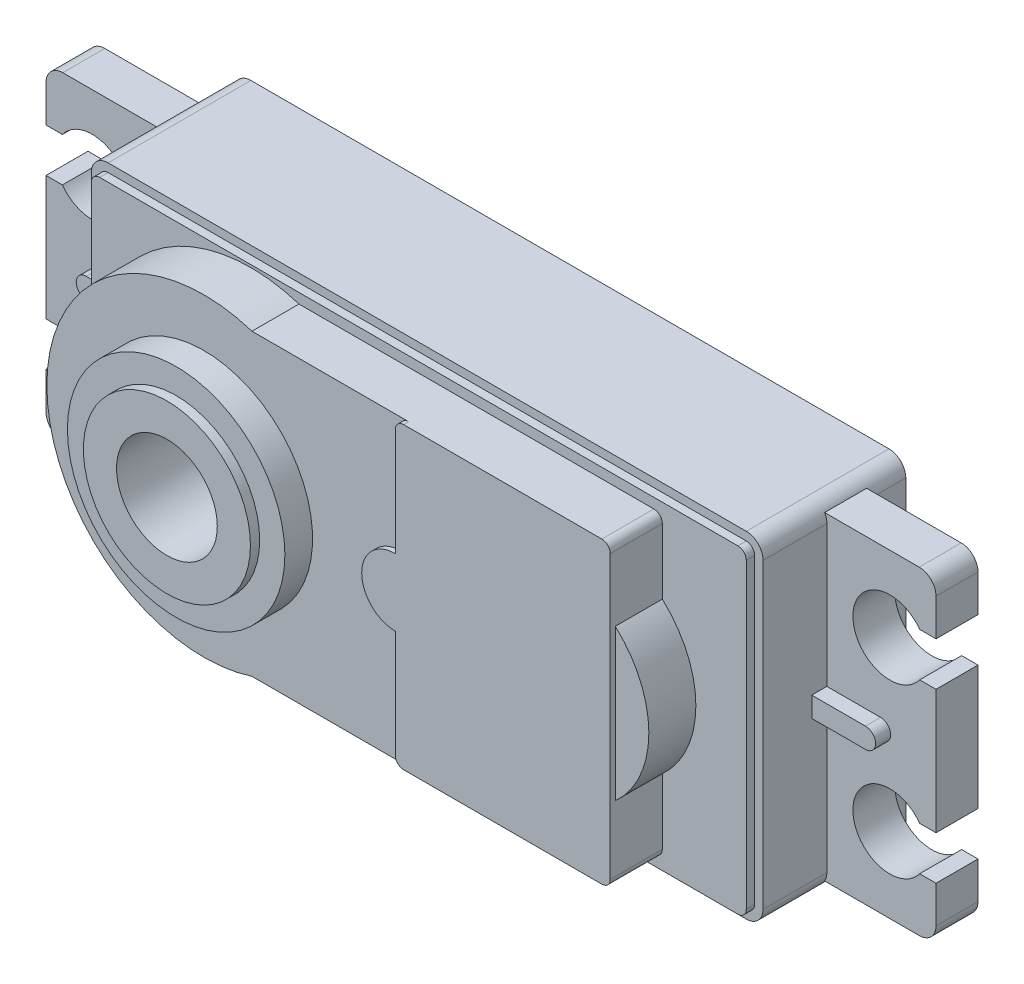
ISO-10303-21;
HEADER;
FILE_DESCRIPTION(('STEP AP214'),'2;1');
FILE_NAME('part.step','',(''),(''),'','','');
FILE_SCHEMA(('AUTOMOTIVE_DESIGN { 1 0 10303 214 1 1 1 1 }'));
ENDSEC;
DATA;
#1=APPLICATION_CONTEXT('core data for automotive mechanical design processes');
#2=APPLICATION_PROTOCOL_DEFINITION('international standard','automotive_design',2000,#1);
#3=PRODUCT_CONTEXT('',#1,'mechanical');
#4=PRODUCT('Part','Part','',(#3));
#5=PRODUCT_RELATED_PRODUCT_CATEGORY('part','',(#4));
#6=PRODUCT_DEFINITION_FORMATION('','',#4);
#7=PRODUCT_DEFINITION_CONTEXT('part definition',#1,'design');
#8=PRODUCT_DEFINITION('design','',#6,#7);
#9=PRODUCT_DEFINITION_SHAPE('','',#8);
#10=(LENGTH_UNIT() NAMED_UNIT(*) SI_UNIT(.MILLI.,.METRE.));
#11=(NAMED_UNIT(*) PLANE_ANGLE_UNIT() SI_UNIT($,.RADIAN.));
#12=(NAMED_UNIT(*) SI_UNIT($,.STERADIAN.) SOLID_ANGLE_UNIT());
#13=UNCERTAINTY_MEASURE_WITH_UNIT(LENGTH_MEASURE(1.E-05),#10,'distance_accuracy_value','');
#14=(GEOMETRIC_REPRESENTATION_CONTEXT(3) GLOBAL_UNCERTAINTY_ASSIGNED_CONTEXT((#13)) GLOBAL_UNIT_ASSIGNED_CONTEXT((#10,
#11,#12)) REPRESENTATION_CONTEXT('',''));
#15=CARTESIAN_POINT('',(0.,0.,0.));
#16=DIRECTION('',(0.,0.,1.));
#17=DIRECTION('',(1.,0.,0.));
#18=AXIS2_PLACEMENT_3D('',#15,#16,#17);
#19=CARTESIAN_POINT('',(19.,-9.,8.5));
#20=DIRECTION('',(0.,0.,-1.));
#21=DIRECTION('',(-1.,0.,0.));
#22=AXIS2_PLACEMENT_3D('',#19,#20,#21);
#23=CYLINDRICAL_SURFACE('',#22,0.999999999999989);
#24=CARTESIAN_POINT('',(19.,-9.,4.7));
#25=DIRECTION('',(0.,0.,-1.));
#26=DIRECTION('',(-1.,0.,0.));
#27=AXIS2_PLACEMENT_3D('',#24,#25,#26);
#28=CIRCLE('',#27,0.999999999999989);
#29=CARTESIAN_POINT('',(20.,-9.00000000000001,4.7));
#30=VERTEX_POINT('',#29);
#31=CARTESIAN_POINT('',(19.8660254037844,-9.5,4.7));
#32=VERTEX_POINT('',#31);
#33=EDGE_CURVE('E498',#30,#32,#28,.T.);
#34=ORIENTED_EDGE('',*,*,#33,.F.);
#35=DIRECTION('',(0.,0.,-1.));
#36=VECTOR('',#35,1.);
#37=CARTESIAN_POINT('',(20.,-9.00000000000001,8.5));
#38=LINE('',#37,#36);
#39=CARTESIAN_POINT('',(20.,-9.00000000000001,8.5));
#40=VERTEX_POINT('',#39);
#41=EDGE_CURVE('E493',#40,#30,#38,.T.);
#42=ORIENTED_EDGE('',*,*,#41,.F.);
#43=CARTESIAN_POINT('',(19.,-9.,8.5));
#44=DIRECTION('',(0.,0.,1.));
#45=DIRECTION('',(1.,0.,0.));
#46=AXIS2_PLACEMENT_3D('',#43,#44,#45);
#47=CIRCLE('',#46,0.999999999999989);
#48=CARTESIAN_POINT('',(19.,-9.99999999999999,8.5));
#49=VERTEX_POINT('',#48);
#50=EDGE_CURVE('E853',#49,#40,#47,.T.);
#51=ORIENTED_EDGE('',*,*,#50,.F.);
#52=DIRECTION('',(0.,0.,-1.));
#53=VECTOR('',#52,1.);
#54=CARTESIAN_POINT('',(19.,-9.99999999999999,8.5));
#55=LINE('',#54,#53);
#56=CARTESIAN_POINT('',(19.,-9.99999999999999,0.));
#57=VERTEX_POINT('',#56);
#58=EDGE_CURVE('E732',#49,#57,#55,.T.);
#59=ORIENTED_EDGE('',*,*,#58,.T.);
#60=CARTESIAN_POINT('',(19.,-9.,0.));
#61=DIRECTION('',(0.,0.,1.));
#62=DIRECTION('',(1.,0.,0.));
#63=AXIS2_PLACEMENT_3D('',#60,#61,#62);
#64=CIRCLE('',#63,0.999999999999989);
#65=CARTESIAN_POINT('',(20.,-9.00000000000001,0.));
#66=VERTEX_POINT('',#65);
#67=EDGE_CURVE('E834',#57,#66,#64,.T.);
#68=ORIENTED_EDGE('',*,*,#67,.T.);
#69=CARTESIAN_POINT('',(20.,-9.00000000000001,2.2));
#70=VERTEX_POINT('',#69);
#71=EDGE_CURVE('E725',#70,#66,#38,.T.);
#72=ORIENTED_EDGE('',*,*,#71,.F.);
#73=CARTESIAN_POINT('',(19.,-9.,2.2));
#74=DIRECTION('',(0.,0.,-1.));
#75=DIRECTION('',(-1.,0.,0.));
#76=AXIS2_PLACEMENT_3D('',#73,#74,#75);
#77=CIRCLE('',#76,0.999999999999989);
#78=CARTESIAN_POINT('',(19.8660254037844,-9.5,2.2));
#79=VERTEX_POINT('',#78);
#80=EDGE_CURVE('E495',#70,#79,#77,.T.);
#81=ORIENTED_EDGE('',*,*,#80,.T.);
#82=DIRECTION('',(0.,0.,-1.));
#83=VECTOR('',#82,1.);
#84=CARTESIAN_POINT('',(19.8660254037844,-9.5,4.7));
#85=LINE('',#84,#83);
#86=EDGE_CURVE('E1181',#32,#79,#85,.T.);
#87=ORIENTED_EDGE('',*,*,#86,.F.);
#88=EDGE_LOOP('',(#34,#42,#51,#59,#68,#72,#81,#87));
#89=FACE_BOUND('',#88,.T.);
#90=ADVANCED_FACE('F34',(#89),#23,.T.);
#91=CARTESIAN_POINT('',(20.,-9.00000000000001,8.5));
#92=DIRECTION('',(-1.,0.,0.));
#93=DIRECTION('',(0.,-1.,0.));
#94=AXIS2_PLACEMENT_3D('',#91,#92,#93);
#95=PLANE('',#94);
#96=DIRECTION('',(0.,-1.,0.));
#97=VECTOR('',#96,1.);
#98=CARTESIAN_POINT('',(20.,-9.00000000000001,4.7));
#99=LINE('',#98,#97);
#100=CARTESIAN_POINT('',(20.,-0.6,4.7));
#101=VERTEX_POINT('',#100);
#102=EDGE_CURVE('E485',#101,#30,#99,.T.);
#103=ORIENTED_EDGE('',*,*,#102,.F.);
#104=DIRECTION('',(0.,0.,-1.));
#105=VECTOR('',#104,1.);
#106=CARTESIAN_POINT('',(20.,-0.6,5.6));
#107=LINE('',#106,#105);
#108=CARTESIAN_POINT('',(20.,-0.6,5.6));
#109=VERTEX_POINT('',#108);
#110=EDGE_CURVE('E471',#109,#101,#107,.T.);
#111=ORIENTED_EDGE('',*,*,#110,.F.);
#112=DIRECTION('',(0.,1.,0.));
#113=VECTOR('',#112,1.);
#114=CARTESIAN_POINT('',(20.,0.6,5.6));
#115=LINE('',#114,#113);
#116=CARTESIAN_POINT('',(20.,0.6,5.6));
#117=VERTEX_POINT('',#116);
#118=EDGE_CURVE('E1110',#109,#117,#115,.T.);
#119=ORIENTED_EDGE('',*,*,#118,.T.);
#120=DIRECTION('',(0.,0.,-1.));
#121=VECTOR('',#120,1.);
#122=CARTESIAN_POINT('',(20.,0.6,5.6));
#123=LINE('',#122,#121);
#124=CARTESIAN_POINT('',(20.,0.6,4.7));
#125=VERTEX_POINT('',#124);
#126=EDGE_CURVE('E1125',#117,#125,#123,.T.);
#127=ORIENTED_EDGE('',*,*,#126,.T.);
#128=CARTESIAN_POINT('',(20.,9.00000000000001,4.7));
#129=VERTEX_POINT('',#128);
#130=EDGE_CURVE('E494',#129,#125,#99,.T.);
#131=ORIENTED_EDGE('',*,*,#130,.F.);
#132=DIRECTION('',(0.,0.,-1.));
#133=VECTOR('',#132,1.);
#134=CARTESIAN_POINT('',(20.,9.00000000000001,8.5));
#135=LINE('',#134,#133);
#136=CARTESIAN_POINT('',(20.,9.00000000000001,8.5));
#137=VERTEX_POINT('',#136);
#138=EDGE_CURVE('E721',#137,#129,#135,.T.);
#139=ORIENTED_EDGE('',*,*,#138,.F.);
#140=DIRECTION('',(0.,1.,0.));
#141=VECTOR('',#140,1.);
#142=CARTESIAN_POINT('',(20.,-9.00000000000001,8.5));
#143=LINE('',#142,#141);
#144=EDGE_CURVE('E855',#40,#137,#143,.T.);
#145=ORIENTED_EDGE('',*,*,#144,.F.);
#146=ORIENTED_EDGE('',*,*,#41,.T.);
#147=EDGE_LOOP('',(#103,#111,#119,#127,#131,#139,#145,#146));
#148=FACE_BOUND('',#147,.T.);
#149=ADVANCED_FACE('F490',(#148),#95,.F.);
#150=CARTESIAN_POINT('',(19.,9.,8.5));
#151=DIRECTION('',(0.,0.,-1.));
#152=DIRECTION('',(-1.,0.,0.));
#153=AXIS2_PLACEMENT_3D('',#150,#151,#152);
#154=CYLINDRICAL_SURFACE('',#153,0.999999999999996);
#155=CARTESIAN_POINT('',(19.,9.,4.7));
#156=DIRECTION('',(0.,0.,-1.));
#157=DIRECTION('',(-1.,0.,0.));
#158=AXIS2_PLACEMENT_3D('',#155,#156,#157);
#159=CIRCLE('',#158,0.999999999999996);
#160=CARTESIAN_POINT('',(19.8660254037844,9.5,4.7));
#161=VERTEX_POINT('',#160);
#162=EDGE_CURVE('E12',#161,#129,#159,.T.);
#163=ORIENTED_EDGE('',*,*,#162,.F.);
#164=DIRECTION('',(0.,0.,-1.));
#165=VECTOR('',#164,1.);
#166=CARTESIAN_POINT('',(19.8660254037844,9.5,4.7));
#167=LINE('',#166,#165);
#168=CARTESIAN_POINT('',(19.8660254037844,9.5,2.2));
#169=VERTEX_POINT('',#168);
#170=EDGE_CURVE('E712',#161,#169,#167,.T.);
#171=ORIENTED_EDGE('',*,*,#170,.T.);
#172=CARTESIAN_POINT('',(19.,9.,2.2));
#173=DIRECTION('',(0.,0.,-1.));
#174=DIRECTION('',(-1.,0.,0.));
#175=AXIS2_PLACEMENT_3D('',#172,#173,#174);
#176=CIRCLE('',#175,0.999999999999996);
#177=CARTESIAN_POINT('',(20.,9.00000000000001,2.2));
#178=VERTEX_POINT('',#177);
#179=EDGE_CURVE('E42',#169,#178,#176,.T.);
#180=ORIENTED_EDGE('',*,*,#179,.T.);
#181=CARTESIAN_POINT('',(20.,9.00000000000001,0.));
#182=VERTEX_POINT('',#181);
#183=EDGE_CURVE('E709',#178,#182,#135,.T.);
#184=ORIENTED_EDGE('',*,*,#183,.T.);
#185=CARTESIAN_POINT('',(19.,9.,0.));
#186=DIRECTION('',(0.,0.,1.));
#187=DIRECTION('',(1.,0.,0.));
#188=AXIS2_PLACEMENT_3D('',#185,#186,#187);
#189=CIRCLE('',#188,0.999999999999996);
#190=CARTESIAN_POINT('',(19.,9.99999999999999,0.));
#191=VERTEX_POINT('',#190);
#192=EDGE_CURVE('E838',#182,#191,#189,.T.);
#193=ORIENTED_EDGE('',*,*,#192,.T.);
#194=DIRECTION('',(0.,0.,-1.));
#195=VECTOR('',#194,1.);
#196=CARTESIAN_POINT('',(19.,9.99999999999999,8.5));
#197=LINE('',#196,#195);
#198=CARTESIAN_POINT('',(19.,9.99999999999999,8.5));
#199=VERTEX_POINT('',#198);
#200=EDGE_CURVE('E722',#199,#191,#197,.T.);
#201=ORIENTED_EDGE('',*,*,#200,.F.);
#202=CARTESIAN_POINT('',(19.,9.,8.5));
#203=DIRECTION('',(0.,0.,1.));
#204=DIRECTION('',(1.,0.,0.));
#205=AXIS2_PLACEMENT_3D('',#202,#203,#204);
#206=CIRCLE('',#205,0.999999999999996);
#207=EDGE_CURVE('E857',#137,#199,#206,.T.);
#208=ORIENTED_EDGE('',*,*,#207,.F.);
#209=ORIENTED_EDGE('',*,*,#138,.T.);
#210=EDGE_LOOP('',(#163,#171,#180,#184,#193,#201,#208,#209));
#211=FACE_BOUND('',#210,.T.);
#212=ADVANCED_FACE('F708',(#211),#154,.T.);
#213=CARTESIAN_POINT('',(-20.,9.,8.5));
#214=DIRECTION('',(1.,0.,0.));
#215=DIRECTION('',(0.,0.,-1.));
#216=AXIS2_PLACEMENT_3D('',#213,#214,#215);
#217=PLANE('',#216);
#218=DIRECTION('',(0.,0.,-1.));
#219=VECTOR('',#218,1.);
#220=CARTESIAN_POINT('',(-20.,0.6,5.6));
#221=LINE('',#220,#219);
#222=CARTESIAN_POINT('',(-20.,0.6,5.6));
#223=VERTEX_POINT('',#222);
#224=CARTESIAN_POINT('',(-20.,0.6,4.7));
#225=VERTEX_POINT('',#224);
#226=EDGE_CURVE('E532',#223,#225,#221,.T.);
#227=ORIENTED_EDGE('',*,*,#226,.F.);
#228=DIRECTION('',(0.,1.,0.));
#229=VECTOR('',#228,1.);
#230=CARTESIAN_POINT('',(-20.,0.6,5.6));
#231=LINE('',#230,#229);
#232=CARTESIAN_POINT('',(-20.,-0.600000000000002,5.6));
#233=VERTEX_POINT('',#232);
#234=EDGE_CURVE('E513',#233,#223,#231,.T.);
#235=ORIENTED_EDGE('',*,*,#234,.F.);
#236=DIRECTION('',(0.,0.,-1.));
#237=VECTOR('',#236,1.);
#238=CARTESIAN_POINT('',(-20.,-0.6,5.6));
#239=LINE('',#238,#237);
#240=CARTESIAN_POINT('',(-20.,-0.6,4.7));
#241=VERTEX_POINT('',#240);
#242=EDGE_CURVE('E523',#233,#241,#239,.T.);
#243=ORIENTED_EDGE('',*,*,#242,.T.);
#244=DIRECTION('',(0.,1.,0.));
#245=VECTOR('',#244,1.);
#246=CARTESIAN_POINT('',(-20.,9.,4.7));
#247=LINE('',#246,#245);
#248=CARTESIAN_POINT('',(-20.,-9.,4.7));
#249=VERTEX_POINT('',#248);
#250=EDGE_CURVE('E703',#249,#241,#247,.T.);
#251=ORIENTED_EDGE('',*,*,#250,.F.);
#252=DIRECTION('',(0.,0.,-1.));
#253=VECTOR('',#252,1.);
#254=CARTESIAN_POINT('',(-20.,-9.,8.5));
#255=LINE('',#254,#253);
#256=CARTESIAN_POINT('',(-20.,-9.,8.5));
#257=VERTEX_POINT('',#256);
#258=EDGE_CURVE('E866',#257,#249,#255,.T.);
#259=ORIENTED_EDGE('',*,*,#258,.F.);
#260=DIRECTION('',(0.,-1.,0.));
#261=VECTOR('',#260,1.);
#262=CARTESIAN_POINT('',(-20.,9.,8.5));
#263=LINE('',#262,#261);
#264=CARTESIAN_POINT('',(-20.,9.,8.5));
#265=VERTEX_POINT('',#264);
#266=EDGE_CURVE('E863',#265,#257,#263,.T.);
#267=ORIENTED_EDGE('',*,*,#266,.F.);
#268=DIRECTION('',(0.,0.,-1.));
#269=VECTOR('',#268,1.);
#270=CARTESIAN_POINT('',(-20.,9.,8.5));
#271=LINE('',#270,#269);
#272=CARTESIAN_POINT('',(-20.,9.,4.7));
#273=VERTEX_POINT('',#272);
#274=EDGE_CURVE('E870',#265,#273,#271,.T.);
#275=ORIENTED_EDGE('',*,*,#274,.T.);
#276=EDGE_CURVE('E702',#225,#273,#247,.T.);
#277=ORIENTED_EDGE('',*,*,#276,.F.);
#278=EDGE_LOOP('',(#227,#235,#243,#251,#259,#267,#275,#277));
#279=FACE_BOUND('',#278,.T.);
#280=ADVANCED_FACE('F906',(#279),#217,.F.);
#281=CARTESIAN_POINT('',(-25.5,-8.5,4.7));
#282=DIRECTION('',(0.,0.,-1.));
#283=DIRECTION('',(-1.,0.,0.));
#284=AXIS2_PLACEMENT_3D('',#281,#282,#283);
#285=PLANE('',#284);
#286=DIRECTION('',(-1.,0.,0.));
#287=VECTOR('',#286,1.);
#288=CARTESIAN_POINT('',(-20.,0.6,4.7));
#289=LINE('',#288,#287);
#290=CARTESIAN_POINT('',(-23.2,0.6,4.7));
#291=VERTEX_POINT('',#290);
#292=EDGE_CURVE('E504',#225,#291,#289,.T.);
#293=ORIENTED_EDGE('',*,*,#292,.F.);
#294=ORIENTED_EDGE('',*,*,#276,.T.);
#295=CARTESIAN_POINT('',(-19.,8.99999999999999,4.7));
#296=DIRECTION('',(0.,0.,-1.));
#297=DIRECTION('',(-1.,0.,0.));
#298=AXIS2_PLACEMENT_3D('',#295,#296,#297);
#299=CIRCLE('',#298,0.999999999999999);
#300=CARTESIAN_POINT('',(-19.8660254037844,9.5,4.7));
#301=VERTEX_POINT('',#300);
#302=EDGE_CURVE('E648',#273,#301,#299,.T.);
#303=ORIENTED_EDGE('',*,*,#302,.T.);
#304=DIRECTION('',(1.,0.,0.));
#305=VECTOR('',#304,1.);
#306=CARTESIAN_POINT('',(-19.8660254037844,9.5,4.7));
#307=LINE('',#306,#305);
#308=CARTESIAN_POINT('',(-25.5,9.5,4.7));
#309=VERTEX_POINT('',#308);
#310=EDGE_CURVE('E610',#309,#301,#307,.T.);
#311=ORIENTED_EDGE('',*,*,#310,.F.);
#312=CARTESIAN_POINT('',(-25.5,8.5,4.7));
#313=DIRECTION('',(0.,0.,-1.));
#314=DIRECTION('',(-1.,0.,0.));
#315=AXIS2_PLACEMENT_3D('',#312,#313,#314);
#316=CIRCLE('',#315,1.);
#317=CARTESIAN_POINT('',(-26.5,8.5,4.7));
#318=VERTEX_POINT('',#317);
#319=EDGE_CURVE('E607',#318,#309,#316,.T.);
#320=ORIENTED_EDGE('',*,*,#319,.F.);
#321=DIRECTION('',(0.,1.,0.));
#322=VECTOR('',#321,1.);
#323=CARTESIAN_POINT('',(-26.5,8.5,4.7));
#324=LINE('',#323,#322);
#325=CARTESIAN_POINT('',(-26.5,6.3,4.7));
#326=VERTEX_POINT('',#325);
#327=EDGE_CURVE('E604',#326,#318,#324,.T.);
#328=ORIENTED_EDGE('',*,*,#327,.F.);
#329=DIRECTION('',(-1.,0.,0.));
#330=VECTOR('',#329,1.);
#331=CARTESIAN_POINT('',(-25.5248239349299,6.3,4.7));
#332=LINE('',#331,#330);
#333=CARTESIAN_POINT('',(-25.5248239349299,6.3,4.7));
#334=VERTEX_POINT('',#333);
#335=EDGE_CURVE('E601',#334,#326,#332,.T.);
#336=ORIENTED_EDGE('',*,*,#335,.F.);
#337=CARTESIAN_POINT('',(-23.75,5.,4.7));
#338=DIRECTION('',(0.,0.,1.));
#339=DIRECTION('',(-1.,0.,0.));
#340=AXIS2_PLACEMENT_3D('',#337,#338,#339);
#341=CIRCLE('',#340,2.2);
#342=CARTESIAN_POINT('',(-25.5248239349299,3.7,4.7));
#343=VERTEX_POINT('',#342);
#344=EDGE_CURVE('E598',#343,#334,#341,.T.);
#345=ORIENTED_EDGE('',*,*,#344,.F.);
#346=DIRECTION('',(1.,0.,0.));
#347=VECTOR('',#346,1.);
#348=CARTESIAN_POINT('',(-25.5248239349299,3.7,4.7));
#349=LINE('',#348,#347);
#350=CARTESIAN_POINT('',(-26.5,3.7,4.7));
#351=VERTEX_POINT('',#350);
#352=EDGE_CURVE('E595',#351,#343,#349,.T.);
#353=ORIENTED_EDGE('',*,*,#352,.F.);
#354=DIRECTION('',(0.,1.,0.));
#355=VECTOR('',#354,1.);
#356=CARTESIAN_POINT('',(-26.5,3.7,4.7));
#357=LINE('',#356,#355);
#358=CARTESIAN_POINT('',(-26.5,-3.7,4.7));
#359=VERTEX_POINT('',#358);
#360=EDGE_CURVE('E592',#359,#351,#357,.T.);
#361=ORIENTED_EDGE('',*,*,#360,.F.);
#362=DIRECTION('',(-1.,0.,0.));
#363=VECTOR('',#362,1.);
#364=CARTESIAN_POINT('',(-25.5248239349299,-3.7,4.7));
#365=LINE('',#364,#363);
#366=CARTESIAN_POINT('',(-25.5248239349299,-3.7,4.7));
#367=VERTEX_POINT('',#366);
#368=EDGE_CURVE('E589',#367,#359,#365,.T.);
#369=ORIENTED_EDGE('',*,*,#368,.F.);
#370=CARTESIAN_POINT('',(-23.75,-5.,4.7));
#371=DIRECTION('',(0.,0.,1.));
#372=DIRECTION('',(1.,0.,0.));
#373=AXIS2_PLACEMENT_3D('',#370,#371,#372);
#374=CIRCLE('',#373,2.2);
#375=CARTESIAN_POINT('',(-25.5248239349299,-6.3,4.7));
#376=VERTEX_POINT('',#375);
#377=EDGE_CURVE('E586',#376,#367,#374,.T.);
#378=ORIENTED_EDGE('',*,*,#377,.F.);
#379=DIRECTION('',(1.,0.,0.));
#380=VECTOR('',#379,1.);
#381=CARTESIAN_POINT('',(-25.5248239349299,-6.3,4.7));
#382=LINE('',#381,#380);
#383=CARTESIAN_POINT('',(-26.5,-6.3,4.7));
#384=VERTEX_POINT('',#383);
#385=EDGE_CURVE('E583',#384,#376,#382,.T.);
#386=ORIENTED_EDGE('',*,*,#385,.F.);
#387=DIRECTION('',(0.,1.,0.));
#388=VECTOR('',#387,1.);
#389=CARTESIAN_POINT('',(-26.5,-6.3,4.7));
#390=LINE('',#389,#388);
#391=CARTESIAN_POINT('',(-26.5,-8.5,4.7));
#392=VERTEX_POINT('',#391);
#393=EDGE_CURVE('E580',#392,#384,#390,.T.);
#394=ORIENTED_EDGE('',*,*,#393,.F.);
#395=CARTESIAN_POINT('',(-25.5,-8.5,4.7));
#396=DIRECTION('',(0.,0.,-1.));
#397=DIRECTION('',(-1.,0.,0.));
#398=AXIS2_PLACEMENT_3D('',#395,#396,#397);
#399=CIRCLE('',#398,1.);
#400=CARTESIAN_POINT('',(-25.5,-9.5,4.7));
#401=VERTEX_POINT('',#400);
#402=EDGE_CURVE('E577',#401,#392,#399,.T.);
#403=ORIENTED_EDGE('',*,*,#402,.F.);
#404=DIRECTION('',(-1.,0.,0.));
#405=VECTOR('',#404,1.);
#406=CARTESIAN_POINT('',(-19.8660254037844,-9.5,4.7));
#407=LINE('',#406,#405);
#408=CARTESIAN_POINT('',(-19.8660254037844,-9.5,4.7));
#409=VERTEX_POINT('',#408);
#410=EDGE_CURVE('E574',#409,#401,#407,.T.);
#411=ORIENTED_EDGE('',*,*,#410,.F.);
#412=CARTESIAN_POINT('',(-19.,-8.99999999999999,4.7));
#413=DIRECTION('',(0.,0.,-1.));
#414=DIRECTION('',(-1.,0.,0.));
#415=AXIS2_PLACEMENT_3D('',#412,#413,#414);
#416=CIRCLE('',#415,0.999999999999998);
#417=EDGE_CURVE('E650',#409,#249,#416,.T.);
#418=ORIENTED_EDGE('',*,*,#417,.T.);
#419=ORIENTED_EDGE('',*,*,#250,.T.);
#420=DIRECTION('',(1.,0.,0.));
#421=VECTOR('',#420,1.);
#422=CARTESIAN_POINT('',(-20.,-0.6,4.7));
#423=LINE('',#422,#421);
#424=CARTESIAN_POINT('',(-23.2,-0.600000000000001,4.7));
#425=VERTEX_POINT('',#424);
#426=EDGE_CURVE('E510',#425,#241,#423,.T.);
#427=ORIENTED_EDGE('',*,*,#426,.F.);
#428=CARTESIAN_POINT('',(-23.2,0.,4.7));
#429=DIRECTION('',(0.,0.,1.));
#430=DIRECTION('',(1.,0.,0.));
#431=AXIS2_PLACEMENT_3D('',#428,#429,#430);
#432=CIRCLE('',#431,0.6);
#433=EDGE_CURVE('E507',#291,#425,#432,.T.);
#434=ORIENTED_EDGE('',*,*,#433,.F.);
#435=EDGE_LOOP('',(#293,#294,#303,#311,#320,#328,#336,#345,#353,#361,#369,#378,#386,#394,#403,
#411,#418,#419,#427,#434));
#436=FACE_BOUND('',#435,.T.);
#437=ADVANCED_FACE('F901',(#436),#285,.F.);
#438=CARTESIAN_POINT('',(-19.,-8.99999999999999,8.5));
#439=DIRECTION('',(0.,0.,-1.));
#440=DIRECTION('',(-1.,0.,0.));
#441=AXIS2_PLACEMENT_3D('',#438,#439,#440);
#442=CYLINDRICAL_SURFACE('',#441,0.999999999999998);
#443=ORIENTED_EDGE('',*,*,#417,.F.);
#444=DIRECTION('',(0.,0.,-1.));
#445=VECTOR('',#444,1.);
#446=CARTESIAN_POINT('',(-19.8660254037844,-9.5,4.7));
#447=LINE('',#446,#445);
#448=CARTESIAN_POINT('',(-19.8660254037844,-9.5,2.2));
#449=VERTEX_POINT('',#448);
#450=EDGE_CURVE('E613',#409,#449,#447,.T.);
#451=ORIENTED_EDGE('',*,*,#450,.T.);
#452=CARTESIAN_POINT('',(-19.,-8.99999999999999,2.2));
#453=DIRECTION('',(0.,0.,-1.));
#454=DIRECTION('',(-1.,0.,0.));
#455=AXIS2_PLACEMENT_3D('',#452,#453,#454);
#456=CIRCLE('',#455,0.999999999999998);
#457=CARTESIAN_POINT('',(-20.,-9.,2.2));
#458=VERTEX_POINT('',#457);
#459=EDGE_CURVE('E645',#449,#458,#456,.T.);
#460=ORIENTED_EDGE('',*,*,#459,.T.);
#461=CARTESIAN_POINT('',(-20.,-9.,0.));
#462=VERTEX_POINT('',#461);
#463=EDGE_CURVE('E865',#458,#462,#255,.T.);
#464=ORIENTED_EDGE('',*,*,#463,.T.);
#465=CARTESIAN_POINT('',(-19.,-8.99999999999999,0.));
#466=DIRECTION('',(0.,0.,1.));
#467=DIRECTION('',(1.,0.,0.));
#468=AXIS2_PLACEMENT_3D('',#465,#466,#467);
#469=CIRCLE('',#468,0.999999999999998);
#470=CARTESIAN_POINT('',(-19.,-9.99999999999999,0.));
#471=VERTEX_POINT('',#470);
#472=EDGE_CURVE('E829',#462,#471,#469,.T.);
#473=ORIENTED_EDGE('',*,*,#472,.T.);
#474=DIRECTION('',(0.,0.,-1.));
#475=VECTOR('',#474,1.);
#476=CARTESIAN_POINT('',(-19.,-9.99999999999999,8.5));
#477=LINE('',#476,#475);
#478=CARTESIAN_POINT('',(-19.,-9.99999999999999,8.5));
#479=VERTEX_POINT('',#478);
#480=EDGE_CURVE('E735',#479,#471,#477,.T.);
#481=ORIENTED_EDGE('',*,*,#480,.F.);
#482=CARTESIAN_POINT('',(-19.,-8.99999999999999,8.5));
#483=DIRECTION('',(0.,0.,1.));
#484=DIRECTION('',(1.,0.,0.));
#485=AXIS2_PLACEMENT_3D('',#482,#483,#484);
#486=CIRCLE('',#485,0.999999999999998);
#487=EDGE_CURVE('E848',#257,#479,#486,.T.);
#488=ORIENTED_EDGE('',*,*,#487,.F.);
#489=ORIENTED_EDGE('',*,*,#258,.T.);
#490=EDGE_LOOP('',(#443,#451,#460,#464,#473,#481,#488,#489));
#491=FACE_BOUND('',#490,.T.);
#492=ADVANCED_FACE('F36',(#491),#442,.T.);
#493=CARTESIAN_POINT('',(-19.,8.99999999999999,8.5));
#494=DIRECTION('',(0.,0.,-1.));
#495=DIRECTION('',(-1.,0.,0.));
#496=AXIS2_PLACEMENT_3D('',#493,#494,#495);
#497=CYLINDRICAL_SURFACE('',#496,0.999999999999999);
#498=ORIENTED_EDGE('',*,*,#302,.F.);
#499=ORIENTED_EDGE('',*,*,#274,.F.);
#500=CARTESIAN_POINT('',(-19.,8.99999999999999,8.5));
#501=DIRECTION('',(0.,0.,1.));
#502=DIRECTION('',(1.,0.,0.));
#503=AXIS2_PLACEMENT_3D('',#500,#501,#502);
#504=CIRCLE('',#503,0.999999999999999);
#505=CARTESIAN_POINT('',(-19.,9.99999999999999,8.5));
#506=VERTEX_POINT('',#505);
#507=EDGE_CURVE('E861',#506,#265,#504,.T.);
#508=ORIENTED_EDGE('',*,*,#507,.F.);
#509=DIRECTION('',(0.,0.,-1.));
#510=VECTOR('',#509,1.);
#511=CARTESIAN_POINT('',(-19.,9.99999999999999,8.5));
#512=LINE('',#511,#510);
#513=CARTESIAN_POINT('',(-19.,9.99999999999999,0.));
#514=VERTEX_POINT('',#513);
#515=EDGE_CURVE('E727',#506,#514,#512,.T.);
#516=ORIENTED_EDGE('',*,*,#515,.T.);
#517=CARTESIAN_POINT('',(-19.,8.99999999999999,0.));
#518=DIRECTION('',(0.,0.,1.));
#519=DIRECTION('',(1.,0.,0.));
#520=AXIS2_PLACEMENT_3D('',#517,#518,#519);
#521=CIRCLE('',#520,0.999999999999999);
#522=CARTESIAN_POINT('',(-20.,9.,0.));
#523=VERTEX_POINT('',#522);
#524=EDGE_CURVE('E842',#514,#523,#521,.T.);
#525=ORIENTED_EDGE('',*,*,#524,.T.);
#526=CARTESIAN_POINT('',(-20.,9.,2.2));
#527=VERTEX_POINT('',#526);
#528=EDGE_CURVE('E869',#527,#523,#271,.T.);
#529=ORIENTED_EDGE('',*,*,#528,.F.);
#530=CARTESIAN_POINT('',(-19.,8.99999999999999,2.2));
#531=DIRECTION('',(0.,0.,-1.));
#532=DIRECTION('',(-1.,0.,0.));
#533=AXIS2_PLACEMENT_3D('',#530,#531,#532);
#534=CIRCLE('',#533,0.999999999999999);
#535=CARTESIAN_POINT('',(-19.8660254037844,9.5,2.2));
#536=VERTEX_POINT('',#535);
#537=EDGE_CURVE('E616',#527,#536,#534,.T.);
#538=ORIENTED_EDGE('',*,*,#537,.T.);
#539=DIRECTION('',(0.,0.,-1.));
#540=VECTOR('',#539,1.);
#541=CARTESIAN_POINT('',(-19.8660254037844,9.5,4.7));
#542=LINE('',#541,#540);
#543=EDGE_CURVE('E614',#301,#536,#542,.T.);
#544=ORIENTED_EDGE('',*,*,#543,.F.);
#545=EDGE_LOOP('',(#498,#499,#508,#516,#525,#529,#538,#544));
#546=FACE_BOUND('',#545,.T.);
#547=ADVANCED_FACE('F878',(#546),#497,.T.);
#548=CARTESIAN_POINT('',(-19.,-8.99999999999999,13.45));
#549=DIRECTION('',(0.,0.,1.));
#550=DIRECTION('',(1.,0.,0.));
#551=AXIS2_PLACEMENT_3D('',#548,#549,#550);
#552=PLANE('',#551);
#553=CARTESIAN_POINT('',(-10.,0.,13.45));
#554=DIRECTION('',(0.,0.,1.));
#555=DIRECTION('',(1.,0.,0.));
#556=AXIS2_PLACEMENT_3D('',#553,#554,#555);
#557=CIRCLE('',#556,6.475);
#558=CARTESIAN_POINT('',(-3.525,0.,13.45));
#559=VERTEX_POINT('',#558);
#560=EDGE_CURVE('E664',#559,#559,#557,.T.);
#561=ORIENTED_EDGE('',*,*,#560,.T.);
#562=EDGE_LOOP('',(#561));
#563=FACE_BOUND('',#562,.T.);
#564=CARTESIAN_POINT('',(-10.,0.,13.45));
#565=DIRECTION('',(0.,0.,1.));
#566=DIRECTION('',(1.,0.,0.));
#567=AXIS2_PLACEMENT_3D('',#564,#565,#566);
#568=CIRCLE('',#567,4.975);
#569=CARTESIAN_POINT('',(-5.025,0.,13.45));
#570=VERTEX_POINT('',#569);
#571=EDGE_CURVE('E658',#570,#570,#568,.T.);
#572=ORIENTED_EDGE('',*,*,#571,.F.);
#573=EDGE_LOOP('',(#572));
#574=FACE_BOUND('',#573,.T.);
#575=ADVANCED_FACE('F1005',(#563,#574),#552,.T.);
#576=CARTESIAN_POINT('',(14.,8.4,11.8));
#577=DIRECTION('',(0.,0.,-1.));
#578=DIRECTION('',(-1.,0.,0.));
#579=AXIS2_PLACEMENT_3D('',#576,#577,#578);
#580=PLANE('',#579);
#581=CARTESIAN_POINT('',(2.2,-8.39999999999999,11.8));
#582=DIRECTION('',(0.,0.,1.));
#583=DIRECTION('',(1.,0.,0.));
#584=AXIS2_PLACEMENT_3D('',#581,#582,#583);
#585=CIRCLE('',#584,0.500000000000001);
#586=CARTESIAN_POINT('',(1.7,-8.39999999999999,11.8));
#587=VERTEX_POINT('',#586);
#588=CARTESIAN_POINT('',(2.2,-8.89999999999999,11.8));
#589=VERTEX_POINT('',#588);
#590=EDGE_CURVE('E677',#587,#589,#585,.T.);
#591=ORIENTED_EDGE('',*,*,#590,.F.);
#592=DIRECTION('',(0.,-1.,0.));
#593=VECTOR('',#592,1.);
#594=CARTESIAN_POINT('',(1.7,-8.39999999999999,11.8));
#595=LINE('',#594,#593);
#596=CARTESIAN_POINT('',(1.7,-2.,11.8));
#597=VERTEX_POINT('',#596);
#598=EDGE_CURVE('E674',#597,#587,#595,.T.);
#599=ORIENTED_EDGE('',*,*,#598,.F.);
#600=CARTESIAN_POINT('',(1.7,0.,11.8));
#601=DIRECTION('',(0.,0.,1.));
#602=DIRECTION('',(1.,0.,0.));
#603=AXIS2_PLACEMENT_3D('',#600,#601,#602);
#604=CIRCLE('',#603,2.);
#605=CARTESIAN_POINT('',(1.7,2.00000000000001,11.8));
#606=VERTEX_POINT('',#605);
#607=EDGE_CURVE('E671',#606,#597,#604,.T.);
#608=ORIENTED_EDGE('',*,*,#607,.F.);
#609=DIRECTION('',(0.,-1.,0.));
#610=VECTOR('',#609,1.);
#611=CARTESIAN_POINT('',(1.7,2.00000000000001,11.8));
#612=LINE('',#611,#610);
#613=CARTESIAN_POINT('',(1.7,8.4,11.8));
#614=VERTEX_POINT('',#613);
#615=EDGE_CURVE('E668',#614,#606,#612,.T.);
#616=ORIENTED_EDGE('',*,*,#615,.F.);
#617=CARTESIAN_POINT('',(2.2,8.4,11.8));
#618=DIRECTION('',(0.,0.,1.));
#619=DIRECTION('',(-1.,0.,0.));
#620=AXIS2_PLACEMENT_3D('',#617,#618,#619);
#621=CIRCLE('',#620,0.5);
#622=CARTESIAN_POINT('',(2.2,8.9,11.8));
#623=VERTEX_POINT('',#622);
#624=EDGE_CURVE('E667',#623,#614,#621,.T.);
#625=ORIENTED_EDGE('',*,*,#624,.F.);
#626=DIRECTION('',(-1.,0.,0.));
#627=VECTOR('',#626,1.);
#628=CARTESIAN_POINT('',(-7.13425402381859,8.9,11.8));
#629=LINE('',#628,#627);
#630=CARTESIAN_POINT('',(-7.13425402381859,8.9,11.8));
#631=VERTEX_POINT('',#630);
#632=EDGE_CURVE('E738',#623,#631,#629,.T.);
#633=ORIENTED_EDGE('',*,*,#632,.T.);
#634=CARTESIAN_POINT('',(-10.,0.,11.8));
#635=DIRECTION('',(0.,0.,1.));
#636=DIRECTION('',(1.,0.,0.));
#637=AXIS2_PLACEMENT_3D('',#634,#635,#636);
#638=CIRCLE('',#637,9.35);
#639=CARTESIAN_POINT('',(-7.13425402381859,-8.9,11.8));
#640=VERTEX_POINT('',#639);
#641=EDGE_CURVE('E741',#631,#640,#638,.T.);
#642=ORIENTED_EDGE('',*,*,#641,.T.);
#643=DIRECTION('',(1.,0.,0.));
#644=VECTOR('',#643,1.);
#645=CARTESIAN_POINT('',(-7.13425402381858,-8.9,11.8));
#646=LINE('',#645,#644);
#647=EDGE_CURVE('E743',#640,#589,#646,.T.);
#648=ORIENTED_EDGE('',*,*,#647,.T.);
#649=EDGE_LOOP('',(#591,#599,#608,#616,#625,#633,#642,#648));
#650=FACE_BOUND('',#649,.T.);
#651=CARTESIAN_POINT('',(-10.,0.,11.8));
#652=DIRECTION('',(0.,0.,-1.));
#653=DIRECTION('',(-1.,0.,0.));
#654=AXIS2_PLACEMENT_3D('',#651,#652,#653);
#655=CIRCLE('',#654,6.475);
#656=CARTESIAN_POINT('',(-16.475,0.,11.8));
#657=VERTEX_POINT('',#656);
#658=EDGE_CURVE('E695',#657,#657,#655,.F.);
#659=ORIENTED_EDGE('',*,*,#658,.F.);
#660=EDGE_LOOP('',(#659));
#661=FACE_BOUND('',#660,.T.);
#662=ADVANCED_FACE('F1498',(#650,#661),#580,.F.);
#663=DIRECTION('',(0.,1.,0.));
#664=VECTOR('',#663,1.);
#665=CARTESIAN_POINT('',(14.5,-8.39999999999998,11.8));
#666=LINE('',#665,#664);
#667=CARTESIAN_POINT('',(14.5,-4.49999999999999,11.8));
#668=VERTEX_POINT('',#667);
#669=CARTESIAN_POINT('',(14.5,4.50000000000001,11.8));
#670=VERTEX_POINT('',#669);
#671=EDGE_CURVE('E699',#668,#670,#666,.T.);
#672=ORIENTED_EDGE('',*,*,#671,.F.);
#673=CARTESIAN_POINT('',(10.4375,0.,11.8));
#674=DIRECTION('',(0.,0.,1.));
#675=DIRECTION('',(1.,0.,0.));
#676=AXIS2_PLACEMENT_3D('',#673,#674,#675);
#677=CIRCLE('',#676,6.06250000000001);
#678=EDGE_CURVE('E756',#668,#670,#677,.T.);
#679=ORIENTED_EDGE('',*,*,#678,.T.);
#680=EDGE_LOOP('',(#672,#679));
#681=FACE_BOUND('',#680,.T.);
#682=ADVANCED_FACE('F995',(#681),#580,.F.);
#683=CARTESIAN_POINT('',(-19.,-8.99999999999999,9.));
#684=DIRECTION('',(0.,0.,1.));
#685=DIRECTION('',(1.,0.,0.));
#686=AXIS2_PLACEMENT_3D('',#683,#684,#685);
#687=PLANE('',#686);
#688=CARTESIAN_POINT('',(-19.,-8.99999999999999,9.));
#689=DIRECTION('',(0.,0.,1.));
#690=DIRECTION('',(1.,0.,0.));
#691=AXIS2_PLACEMENT_3D('',#688,#689,#690);
#692=CIRCLE('',#691,0.499999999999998);
#693=CARTESIAN_POINT('',(-19.5,-9.,9.));
#694=VERTEX_POINT('',#693);
#695=CARTESIAN_POINT('',(-19.,-9.49999999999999,9.));
#696=VERTEX_POINT('',#695);
#697=EDGE_CURVE('E790',#694,#696,#692,.T.);
#698=ORIENTED_EDGE('',*,*,#697,.T.);
#699=DIRECTION('',(1.,0.,0.));
#700=VECTOR('',#699,1.);
#701=CARTESIAN_POINT('',(-19.,-9.49999999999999,9.));
#702=LINE('',#701,#700);
#703=CARTESIAN_POINT('',(19.,-9.49999999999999,9.));
#704=VERTEX_POINT('',#703);
#705=EDGE_CURVE('E793',#696,#704,#702,.T.);
#706=ORIENTED_EDGE('',*,*,#705,.T.);
#707=CARTESIAN_POINT('',(19.,-9.,9.));
#708=DIRECTION('',(0.,0.,1.));
#709=DIRECTION('',(1.,0.,0.));
#710=AXIS2_PLACEMENT_3D('',#707,#708,#709);
#711=CIRCLE('',#710,0.499999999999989);
#712=CARTESIAN_POINT('',(19.5,-9.00000000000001,9.));
#713=VERTEX_POINT('',#712);
#714=EDGE_CURVE('E795',#704,#713,#711,.T.);
#715=ORIENTED_EDGE('',*,*,#714,.T.);
#716=DIRECTION('',(0.,1.,0.));
#717=VECTOR('',#716,1.);
#718=CARTESIAN_POINT('',(19.5,-9.00000000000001,9.));
#719=LINE('',#718,#717);
#720=CARTESIAN_POINT('',(19.5,9.00000000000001,9.));
#721=VERTEX_POINT('',#720);
#722=EDGE_CURVE('E797',#713,#721,#719,.T.);
#723=ORIENTED_EDGE('',*,*,#722,.T.);
#724=CARTESIAN_POINT('',(19.,9.,9.));
#725=DIRECTION('',(0.,0.,1.));
#726=DIRECTION('',(1.,0.,0.));
#727=AXIS2_PLACEMENT_3D('',#724,#725,#726);
#728=CIRCLE('',#727,0.499999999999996);
#729=CARTESIAN_POINT('',(19.,9.5,9.));
#730=VERTEX_POINT('',#729);
#731=EDGE_CURVE('E799',#721,#730,#728,.T.);
#732=ORIENTED_EDGE('',*,*,#731,.T.);
#733=DIRECTION('',(-1.,0.,0.));
#734=VECTOR('',#733,1.);
#735=CARTESIAN_POINT('',(19.,9.5,9.));
#736=LINE('',#735,#734);
#737=CARTESIAN_POINT('',(-19.,9.49999999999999,9.));
#738=VERTEX_POINT('',#737);
#739=EDGE_CURVE('E801',#730,#738,#736,.T.);
#740=ORIENTED_EDGE('',*,*,#739,.T.);
#741=CARTESIAN_POINT('',(-19.,8.99999999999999,9.));
#742=DIRECTION('',(0.,0.,1.));
#743=DIRECTION('',(1.,0.,0.));
#744=AXIS2_PLACEMENT_3D('',#741,#742,#743);
#745=CIRCLE('',#744,0.499999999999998);
#746=CARTESIAN_POINT('',(-19.5,9.,9.));
#747=VERTEX_POINT('',#746);
#748=EDGE_CURVE('E803',#738,#747,#745,.T.);
#749=ORIENTED_EDGE('',*,*,#748,.T.);
#750=DIRECTION('',(0.,-1.,0.));
#751=VECTOR('',#750,1.);
#752=CARTESIAN_POINT('',(-19.5,9.,9.));
#753=LINE('',#752,#751);
#754=EDGE_CURVE('E805',#747,#694,#753,.T.);
#755=ORIENTED_EDGE('',*,*,#754,.T.);
#756=EDGE_LOOP('',(#698,#706,#715,#723,#732,#740,#749,#755));
#757=FACE_BOUND('',#756,.T.);
#758=DIRECTION('',(-1.,0.,0.));
#759=VECTOR('',#758,1.);
#760=CARTESIAN_POINT('',(-7.13425402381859,8.9,9.));
#761=LINE('',#760,#759);
#762=CARTESIAN_POINT('',(14.,8.9,9.));
#763=VERTEX_POINT('',#762);
#764=CARTESIAN_POINT('',(-7.13425402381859,8.9,9.));
#765=VERTEX_POINT('',#764);
#766=EDGE_CURVE('E1879',#763,#765,#761,.T.);
#767=ORIENTED_EDGE('',*,*,#766,.F.);
#768=CARTESIAN_POINT('',(14.,8.4,9.));
#769=DIRECTION('',(0.,0.,1.));
#770=DIRECTION('',(-1.,0.,0.));
#771=AXIS2_PLACEMENT_3D('',#768,#769,#770);
#772=CIRCLE('',#771,0.5);
#773=CARTESIAN_POINT('',(14.5,8.4,9.));
#774=VERTEX_POINT('',#773);
#775=EDGE_CURVE('E1882',#774,#763,#772,.T.);
#776=ORIENTED_EDGE('',*,*,#775,.F.);
#777=DIRECTION('',(0.,1.,0.));
#778=VECTOR('',#777,1.);
#779=CARTESIAN_POINT('',(14.5,8.4,9.));
#780=LINE('',#779,#778);
#781=CARTESIAN_POINT('',(14.5,4.50000000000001,9.));
#782=VERTEX_POINT('',#781);
#783=EDGE_CURVE('E742',#782,#774,#780,.T.);
#784=ORIENTED_EDGE('',*,*,#783,.F.);
#785=CARTESIAN_POINT('',(10.4375,0.,9.));
#786=DIRECTION('',(0.,0.,1.));
#787=DIRECTION('',(1.,0.,0.));
#788=AXIS2_PLACEMENT_3D('',#785,#786,#787);
#789=CIRCLE('',#788,6.06250000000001);
#790=CARTESIAN_POINT('',(14.5,-4.49999999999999,9.));
#791=VERTEX_POINT('',#790);
#792=EDGE_CURVE('E1897',#791,#782,#789,.T.);
#793=ORIENTED_EDGE('',*,*,#792,.F.);
#794=DIRECTION('',(0.,1.,0.));
#795=VECTOR('',#794,1.);
#796=CARTESIAN_POINT('',(14.5,-4.49999999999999,9.));
#797=LINE('',#796,#795);
#798=CARTESIAN_POINT('',(14.5,-8.39999999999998,9.));
#799=VERTEX_POINT('',#798);
#800=EDGE_CURVE('E1896',#799,#791,#797,.T.);
#801=ORIENTED_EDGE('',*,*,#800,.F.);
#802=CARTESIAN_POINT('',(14.,-8.39999999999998,9.));
#803=DIRECTION('',(0.,0.,1.));
#804=DIRECTION('',(1.,0.,0.));
#805=AXIS2_PLACEMENT_3D('',#802,#803,#804);
#806=CIRCLE('',#805,0.5);
#807=CARTESIAN_POINT('',(14.,-8.89999999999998,9.));
#808=VERTEX_POINT('',#807);
#809=EDGE_CURVE('E1894',#808,#799,#806,.T.);
#810=ORIENTED_EDGE('',*,*,#809,.F.);
#811=DIRECTION('',(1.,0.,0.));
#812=VECTOR('',#811,1.);
#813=CARTESIAN_POINT('',(-7.13425402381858,-8.9,9.));
#814=LINE('',#813,#812);
#815=CARTESIAN_POINT('',(-7.13425402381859,-8.9,9.));
#816=VERTEX_POINT('',#815);
#817=EDGE_CURVE('E1887',#816,#808,#814,.T.);
#818=ORIENTED_EDGE('',*,*,#817,.F.);
#819=CARTESIAN_POINT('',(-10.,0.,9.));
#820=DIRECTION('',(0.,0.,1.));
#821=DIRECTION('',(1.,0.,0.));
#822=AXIS2_PLACEMENT_3D('',#819,#820,#821);
#823=CIRCLE('',#822,9.35);
#824=EDGE_CURVE('E1884',#765,#816,#823,.T.);
#825=ORIENTED_EDGE('',*,*,#824,.F.);
#826=EDGE_LOOP('',(#767,#776,#784,#793,#801,#810,#818,#825));
#827=FACE_BOUND('',#826,.T.);
#828=ADVANCED_FACE('F990',(#757,#827),#687,.T.);
#829=CARTESIAN_POINT('',(-19.,-8.99999999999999,8.5));
#830=DIRECTION('',(0.,0.,1.));
#831=DIRECTION('',(1.,0.,0.));
#832=AXIS2_PLACEMENT_3D('',#829,#830,#831);
#833=PLANE('',#832);
#834=ORIENTED_EDGE('',*,*,#487,.T.);
#835=DIRECTION('',(1.,0.,0.));
#836=VECTOR('',#835,1.);
#837=CARTESIAN_POINT('',(-19.,-9.99999999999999,8.5));
#838=LINE('',#837,#836);
#839=EDGE_CURVE('E851',#479,#49,#838,.T.);
#840=ORIENTED_EDGE('',*,*,#839,.T.);
#841=ORIENTED_EDGE('',*,*,#50,.T.);
#842=ORIENTED_EDGE('',*,*,#144,.T.);
#843=ORIENTED_EDGE('',*,*,#207,.T.);
#844=DIRECTION('',(-1.,0.,0.));
#845=VECTOR('',#844,1.);
#846=CARTESIAN_POINT('',(19.,9.99999999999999,8.5));
#847=LINE('',#846,#845);
#848=EDGE_CURVE('E859',#199,#506,#847,.T.);
#849=ORIENTED_EDGE('',*,*,#848,.T.);
#850=ORIENTED_EDGE('',*,*,#507,.T.);
#851=ORIENTED_EDGE('',*,*,#266,.T.);
#852=EDGE_LOOP('',(#834,#840,#841,#842,#843,#849,#850,#851));
#853=FACE_BOUND('',#852,.T.);
#854=DIRECTION('',(1.,0.,0.));
#855=VECTOR('',#854,1.);
#856=CARTESIAN_POINT('',(-19.,-9.49999999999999,8.5));
#857=LINE('',#856,#855);
#858=CARTESIAN_POINT('',(-19.,-9.49999999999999,8.5));
#859=VERTEX_POINT('',#858);
#860=CARTESIAN_POINT('',(19.,-9.49999999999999,8.5));
#861=VERTEX_POINT('',#860);
#862=EDGE_CURVE('E775',#859,#861,#857,.T.);
#863=ORIENTED_EDGE('',*,*,#862,.F.);
#864=CARTESIAN_POINT('',(-19.,-8.99999999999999,8.5));
#865=DIRECTION('',(0.,0.,1.));
#866=DIRECTION('',(1.,0.,0.));
#867=AXIS2_PLACEMENT_3D('',#864,#865,#866);
#868=CIRCLE('',#867,0.499999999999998);
#869=CARTESIAN_POINT('',(-19.5,-9.,8.5));
#870=VERTEX_POINT('',#869);
#871=EDGE_CURVE('E772',#870,#859,#868,.T.);
#872=ORIENTED_EDGE('',*,*,#871,.F.);
#873=DIRECTION('',(0.,-1.,0.));
#874=VECTOR('',#873,1.);
#875=CARTESIAN_POINT('',(-19.5,9.,8.5));
#876=LINE('',#875,#874);
#877=CARTESIAN_POINT('',(-19.5,8.99999999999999,8.5));
#878=VERTEX_POINT('',#877);
#879=EDGE_CURVE('E788',#878,#870,#876,.T.);
#880=ORIENTED_EDGE('',*,*,#879,.F.);
#881=CARTESIAN_POINT('',(-19.,8.99999999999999,8.5));
#882=DIRECTION('',(0.,0.,1.));
#883=DIRECTION('',(1.,0.,0.));
#884=AXIS2_PLACEMENT_3D('',#881,#882,#883);
#885=CIRCLE('',#884,0.499999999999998);
#886=CARTESIAN_POINT('',(-19.,9.49999999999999,8.5));
#887=VERTEX_POINT('',#886);
#888=EDGE_CURVE('E785',#887,#878,#885,.T.);
#889=ORIENTED_EDGE('',*,*,#888,.F.);
#890=DIRECTION('',(-1.,0.,0.));
#891=VECTOR('',#890,1.);
#892=CARTESIAN_POINT('',(19.,9.5,8.5));
#893=LINE('',#892,#891);
#894=CARTESIAN_POINT('',(19.,9.5,8.5));
#895=VERTEX_POINT('',#894);
#896=EDGE_CURVE('E783',#895,#887,#893,.T.);
#897=ORIENTED_EDGE('',*,*,#896,.F.);
#898=CARTESIAN_POINT('',(19.,9.,8.5));
#899=DIRECTION('',(0.,0.,1.));
#900=DIRECTION('',(1.,0.,0.));
#901=AXIS2_PLACEMENT_3D('',#898,#899,#900);
#902=CIRCLE('',#901,0.499999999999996);
#903=CARTESIAN_POINT('',(19.5,9.00000000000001,8.5));
#904=VERTEX_POINT('',#903);
#905=EDGE_CURVE('E781',#904,#895,#902,.T.);
#906=ORIENTED_EDGE('',*,*,#905,.F.);
#907=DIRECTION('',(0.,1.,0.));
#908=VECTOR('',#907,1.);
#909=CARTESIAN_POINT('',(19.5,-9.00000000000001,8.5));
#910=LINE('',#909,#908);
#911=CARTESIAN_POINT('',(19.5,-9.00000000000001,8.5));
#912=VERTEX_POINT('',#911);
#913=EDGE_CURVE('E779',#912,#904,#910,.T.);
#914=ORIENTED_EDGE('',*,*,#913,.F.);
#915=CARTESIAN_POINT('',(19.,-9.,8.5));
#916=DIRECTION('',(0.,0.,1.));
#917=DIRECTION('',(1.,0.,0.));
#918=AXIS2_PLACEMENT_3D('',#915,#916,#917);
#919=CIRCLE('',#918,0.499999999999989);
#920=EDGE_CURVE('E777',#861,#912,#919,.T.);
#921=ORIENTED_EDGE('',*,*,#920,.F.);
#922=EDGE_LOOP('',(#863,#872,#880,#889,#897,#906,#914,#921));
#923=FACE_BOUND('',#922,.T.);
#924=ADVANCED_FACE('F911',(#853,#923),#833,.T.);
#925=CARTESIAN_POINT('',(-19.,-9.99999999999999,8.5));
#926=DIRECTION('',(0.,1.,0.));
#927=DIRECTION('',(-1.,0.,0.));
#928=AXIS2_PLACEMENT_3D('',#925,#926,#927);
#929=PLANE('',#928);
#930=DIRECTION('',(1.,0.,0.));
#931=VECTOR('',#930,1.);
#932=CARTESIAN_POINT('',(-19.,-9.99999999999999,0.));
#933=LINE('',#932,#931);
#934=EDGE_CURVE('E832',#471,#57,#933,.T.);
#935=ORIENTED_EDGE('',*,*,#934,.T.);
#936=ORIENTED_EDGE('',*,*,#58,.F.);
#937=ORIENTED_EDGE('',*,*,#839,.F.);
#938=ORIENTED_EDGE('',*,*,#480,.T.);
#939=EDGE_LOOP('',(#935,#936,#937,#938));
#940=FACE_BOUND('',#939,.T.);
#941=ADVANCED_FACE('F922',(#940),#929,.F.);
#942=ORIENTED_EDGE('',*,*,#183,.F.);
#943=DIRECTION('',(0.,-1.,0.));
#944=VECTOR('',#943,1.);
#945=CARTESIAN_POINT('',(20.,-9.00000000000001,2.2));
#946=LINE('',#945,#944);
#947=EDGE_CURVE('E57',#178,#70,#946,.T.);
#948=ORIENTED_EDGE('',*,*,#947,.T.);
#949=ORIENTED_EDGE('',*,*,#71,.T.);
#950=DIRECTION('',(0.,1.,0.));
#951=VECTOR('',#950,1.);
#952=CARTESIAN_POINT('',(20.,-9.00000000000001,0.));
#953=LINE('',#952,#951);
#954=EDGE_CURVE('E719',#66,#182,#953,.T.);
#955=ORIENTED_EDGE('',*,*,#954,.T.);
#956=EDGE_LOOP('',(#942,#948,#949,#955));
#957=FACE_BOUND('',#956,.T.);
#958=ADVANCED_FACE('F716',(#957),#95,.F.);
#959=CARTESIAN_POINT('',(19.,9.99999999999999,8.5));
#960=DIRECTION('',(0.,-1.,0.));
#961=DIRECTION('',(0.,0.,-1.));
#962=AXIS2_PLACEMENT_3D('',#959,#960,#961);
#963=PLANE('',#962);
#964=DIRECTION('',(-1.,0.,0.));
#965=VECTOR('',#964,1.);
#966=CARTESIAN_POINT('',(19.,9.99999999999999,0.));
#967=LINE('',#966,#965);
#968=EDGE_CURVE('E840',#191,#514,#967,.T.);
#969=ORIENTED_EDGE('',*,*,#968,.T.);
#970=ORIENTED_EDGE('',*,*,#515,.F.);
#971=ORIENTED_EDGE('',*,*,#848,.F.);
#972=ORIENTED_EDGE('',*,*,#200,.T.);
#973=EDGE_LOOP('',(#969,#970,#971,#972));
#974=FACE_BOUND('',#973,.T.);
#975=ADVANCED_FACE('F916',(#974),#963,.F.);
#976=ORIENTED_EDGE('',*,*,#463,.F.);
#977=DIRECTION('',(0.,1.,0.));
#978=VECTOR('',#977,1.);
#979=CARTESIAN_POINT('',(-20.,9.,2.2));
#980=LINE('',#979,#978);
#981=EDGE_CURVE('E698',#458,#527,#980,.T.);
#982=ORIENTED_EDGE('',*,*,#981,.T.);
#983=ORIENTED_EDGE('',*,*,#528,.T.);
#984=DIRECTION('',(0.,-1.,0.));
#985=VECTOR('',#984,1.);
#986=CARTESIAN_POINT('',(-20.,9.,0.));
#987=LINE('',#986,#985);
#988=EDGE_CURVE('E845',#523,#462,#987,.T.);
#989=ORIENTED_EDGE('',*,*,#988,.T.);
#990=EDGE_LOOP('',(#976,#982,#983,#989));
#991=FACE_BOUND('',#990,.T.);
#992=ADVANCED_FACE('F890',(#991),#217,.F.);
#993=CARTESIAN_POINT('',(-19.,-8.99999999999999,0.));
#994=DIRECTION('',(0.,0.,1.));
#995=DIRECTION('',(1.,0.,0.));
#996=AXIS2_PLACEMENT_3D('',#993,#994,#995);
#997=PLANE('',#996);
#998=CARTESIAN_POINT('',(-10.,0.,0.));
#999=DIRECTION('',(0.,0.,1.));
#1000=DIRECTION('',(1.,0.,0.));
#1001=AXIS2_PLACEMENT_3D('',#998,#999,#1000);
#1002=CIRCLE('',#1001,3.);
#1003=CARTESIAN_POINT('',(-7.,0.,0.));
#1004=VERTEX_POINT('',#1003);
#1005=EDGE_CURVE('E655',#1004,#1004,#1002,.T.);
#1006=ORIENTED_EDGE('',*,*,#1005,.T.);
#1007=EDGE_LOOP('',(#1006));
#1008=FACE_BOUND('',#1007,.T.);
#1009=ORIENTED_EDGE('',*,*,#472,.F.);
#1010=ORIENTED_EDGE('',*,*,#988,.F.);
#1011=ORIENTED_EDGE('',*,*,#524,.F.);
#1012=ORIENTED_EDGE('',*,*,#968,.F.);
#1013=ORIENTED_EDGE('',*,*,#192,.F.);
#1014=ORIENTED_EDGE('',*,*,#954,.F.);
#1015=ORIENTED_EDGE('',*,*,#67,.F.);
#1016=ORIENTED_EDGE('',*,*,#934,.F.);
#1017=EDGE_LOOP('',(#1009,#1010,#1011,#1012,#1013,#1014,#1015,#1016));
#1018=FACE_BOUND('',#1017,.T.);
#1019=ADVANCED_FACE('F887',(#1008,#1018),#997,.F.);
#1020=CARTESIAN_POINT('',(-19.,-8.99999999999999,9.));
#1021=DIRECTION('',(0.,0.,-1.));
#1022=DIRECTION('',(-1.,0.,0.));
#1023=AXIS2_PLACEMENT_3D('',#1020,#1021,#1022);
#1024=CYLINDRICAL_SURFACE('',#1023,0.499999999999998);
#1025=ORIENTED_EDGE('',*,*,#871,.T.);
#1026=DIRECTION('',(0.,0.,-1.));
#1027=VECTOR('',#1026,1.);
#1028=CARTESIAN_POINT('',(-19.,-9.49999999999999,9.));
#1029=LINE('',#1028,#1027);
#1030=EDGE_CURVE('E827',#696,#859,#1029,.T.);
#1031=ORIENTED_EDGE('',*,*,#1030,.F.);
#1032=ORIENTED_EDGE('',*,*,#697,.F.);
#1033=DIRECTION('',(0.,0.,-1.));
#1034=VECTOR('',#1033,1.);
#1035=CARTESIAN_POINT('',(-19.5,-9.,9.));
#1036=LINE('',#1035,#1034);
#1037=EDGE_CURVE('E807',#694,#870,#1036,.T.);
#1038=ORIENTED_EDGE('',*,*,#1037,.T.);
#1039=EDGE_LOOP('',(#1025,#1031,#1032,#1038));
#1040=FACE_BOUND('',#1039,.T.);
#1041=ADVANCED_FACE('F1479',(#1040),#1024,.T.);
#1042=CARTESIAN_POINT('',(-19.,-9.49999999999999,9.));
#1043=DIRECTION('',(0.,1.,0.));
#1044=DIRECTION('',(-1.,0.,0.));
#1045=AXIS2_PLACEMENT_3D('',#1042,#1043,#1044);
#1046=PLANE('',#1045);
#1047=ORIENTED_EDGE('',*,*,#862,.T.);
#1048=DIRECTION('',(0.,0.,-1.));
#1049=VECTOR('',#1048,1.);
#1050=CARTESIAN_POINT('',(19.,-9.49999999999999,9.));
#1051=LINE('',#1050,#1049);
#1052=EDGE_CURVE('E824',#704,#861,#1051,.T.);
#1053=ORIENTED_EDGE('',*,*,#1052,.F.);
#1054=ORIENTED_EDGE('',*,*,#705,.F.);
#1055=ORIENTED_EDGE('',*,*,#1030,.T.);
#1056=EDGE_LOOP('',(#1047,#1053,#1054,#1055));
#1057=FACE_BOUND('',#1056,.T.);
#1058=ADVANCED_FACE('F1726',(#1057),#1046,.F.);
#1059=CARTESIAN_POINT('',(19.,-9.,9.));
#1060=DIRECTION('',(0.,0.,-1.));
#1061=DIRECTION('',(-1.,0.,0.));
#1062=AXIS2_PLACEMENT_3D('',#1059,#1060,#1061);
#1063=CYLINDRICAL_SURFACE('',#1062,0.499999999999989);
#1064=ORIENTED_EDGE('',*,*,#920,.T.);
#1065=DIRECTION('',(0.,0.,-1.));
#1066=VECTOR('',#1065,1.);
#1067=CARTESIAN_POINT('',(19.5,-9.00000000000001,9.));
#1068=LINE('',#1067,#1066);
#1069=EDGE_CURVE('E821',#713,#912,#1068,.T.);
#1070=ORIENTED_EDGE('',*,*,#1069,.F.);
#1071=ORIENTED_EDGE('',*,*,#714,.F.);
#1072=ORIENTED_EDGE('',*,*,#1052,.T.);
#1073=EDGE_LOOP('',(#1064,#1070,#1071,#1072));
#1074=FACE_BOUND('',#1073,.T.);
#1075=ADVANCED_FACE('F1716',(#1074),#1063,.T.);
#1076=CARTESIAN_POINT('',(19.5,-9.00000000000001,9.));
#1077=DIRECTION('',(-1.,0.,0.));
#1078=DIRECTION('',(0.,-1.,0.));
#1079=AXIS2_PLACEMENT_3D('',#1076,#1077,#1078);
#1080=PLANE('',#1079);
#1081=ORIENTED_EDGE('',*,*,#913,.T.);
#1082=DIRECTION('',(0.,0.,-1.));
#1083=VECTOR('',#1082,1.);
#1084=CARTESIAN_POINT('',(19.5,9.00000000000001,9.));
#1085=LINE('',#1084,#1083);
#1086=EDGE_CURVE('E818',#721,#904,#1085,.T.);
#1087=ORIENTED_EDGE('',*,*,#1086,.F.);
#1088=ORIENTED_EDGE('',*,*,#722,.F.);
#1089=ORIENTED_EDGE('',*,*,#1069,.T.);
#1090=EDGE_LOOP('',(#1081,#1087,#1088,#1089));
#1091=FACE_BOUND('',#1090,.T.);
#1092=ADVANCED_FACE('F1706',(#1091),#1080,.F.);
#1093=CARTESIAN_POINT('',(19.,9.,9.));
#1094=DIRECTION('',(0.,0.,-1.));
#1095=DIRECTION('',(-1.,0.,0.));
#1096=AXIS2_PLACEMENT_3D('',#1093,#1094,#1095);
#1097=CYLINDRICAL_SURFACE('',#1096,0.499999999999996);
#1098=ORIENTED_EDGE('',*,*,#905,.T.);
#1099=DIRECTION('',(0.,0.,-1.));
#1100=VECTOR('',#1099,1.);
#1101=CARTESIAN_POINT('',(19.,9.5,9.));
#1102=LINE('',#1101,#1100);
#1103=EDGE_CURVE('E815',#730,#895,#1102,.T.);
#1104=ORIENTED_EDGE('',*,*,#1103,.F.);
#1105=ORIENTED_EDGE('',*,*,#731,.F.);
#1106=ORIENTED_EDGE('',*,*,#1086,.T.);
#1107=EDGE_LOOP('',(#1098,#1104,#1105,#1106));
#1108=FACE_BOUND('',#1107,.T.);
#1109=ADVANCED_FACE('F1696',(#1108),#1097,.T.);
#1110=CARTESIAN_POINT('',(19.,9.5,9.));
#1111=DIRECTION('',(0.,-1.,0.));
#1112=DIRECTION('',(1.,0.,0.));
#1113=AXIS2_PLACEMENT_3D('',#1110,#1111,#1112);
#1114=PLANE('',#1113);
#1115=ORIENTED_EDGE('',*,*,#896,.T.);
#1116=DIRECTION('',(0.,0.,-1.));
#1117=VECTOR('',#1116,1.);
#1118=CARTESIAN_POINT('',(-19.,9.49999999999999,9.));
#1119=LINE('',#1118,#1117);
#1120=EDGE_CURVE('E812',#738,#887,#1119,.T.);
#1121=ORIENTED_EDGE('',*,*,#1120,.F.);
#1122=ORIENTED_EDGE('',*,*,#739,.F.);
#1123=ORIENTED_EDGE('',*,*,#1103,.T.);
#1124=EDGE_LOOP('',(#1115,#1121,#1122,#1123));
#1125=FACE_BOUND('',#1124,.T.);
#1126=ADVANCED_FACE('F1686',(#1125),#1114,.F.);
#1127=CARTESIAN_POINT('',(-19.,8.99999999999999,9.));
#1128=DIRECTION('',(0.,0.,-1.));
#1129=DIRECTION('',(-1.,0.,0.));
#1130=AXIS2_PLACEMENT_3D('',#1127,#1128,#1129);
#1131=CYLINDRICAL_SURFACE('',#1130,0.499999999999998);
#1132=ORIENTED_EDGE('',*,*,#888,.T.);
#1133=DIRECTION('',(0.,0.,-1.));
#1134=VECTOR('',#1133,1.);
#1135=CARTESIAN_POINT('',(-19.5,9.,9.));
#1136=LINE('',#1135,#1134);
#1137=EDGE_CURVE('E810',#747,#878,#1136,.T.);
#1138=ORIENTED_EDGE('',*,*,#1137,.F.);
#1139=ORIENTED_EDGE('',*,*,#748,.F.);
#1140=ORIENTED_EDGE('',*,*,#1120,.T.);
#1141=EDGE_LOOP('',(#1132,#1138,#1139,#1140));
#1142=FACE_BOUND('',#1141,.T.);
#1143=ADVANCED_FACE('F1676',(#1142),#1131,.T.);
#1144=CARTESIAN_POINT('',(-19.5,9.,9.));
#1145=DIRECTION('',(1.,0.,0.));
#1146=DIRECTION('',(0.,0.,-1.));
#1147=AXIS2_PLACEMENT_3D('',#1144,#1145,#1146);
#1148=PLANE('',#1147);
#1149=ORIENTED_EDGE('',*,*,#879,.T.);
#1150=ORIENTED_EDGE('',*,*,#1037,.F.);
#1151=ORIENTED_EDGE('',*,*,#754,.F.);
#1152=ORIENTED_EDGE('',*,*,#1137,.T.);
#1153=EDGE_LOOP('',(#1149,#1150,#1151,#1152));
#1154=FACE_BOUND('',#1153,.T.);
#1155=ADVANCED_FACE('F1645',(#1154),#1148,.F.);
#1156=CARTESIAN_POINT('',(14.,8.4,11.8));
#1157=DIRECTION('',(0.,0.,-1.));
#1158=DIRECTION('',(-1.,0.,0.));
#1159=AXIS2_PLACEMENT_3D('',#1156,#1157,#1158);
#1160=CYLINDRICAL_SURFACE('',#1159,0.5);
#1161=ORIENTED_EDGE('',*,*,#775,.T.);
#1162=DIRECTION('',(0.,0.,-1.));
#1163=VECTOR('',#1162,1.);
#1164=CARTESIAN_POINT('',(14.,8.9,11.8));
#1165=LINE('',#1164,#1163);
#1166=CARTESIAN_POINT('',(14.,8.90000000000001,12.1));
#1167=VERTEX_POINT('',#1166);
#1168=EDGE_CURVE('E770',#1167,#763,#1165,.T.);
#1169=ORIENTED_EDGE('',*,*,#1168,.F.);
#1170=CARTESIAN_POINT('',(14.,8.4,12.1));
#1171=DIRECTION('',(0.,0.,1.));
#1172=DIRECTION('',(1.,0.,0.));
#1173=AXIS2_PLACEMENT_3D('',#1170,#1171,#1172);
#1174=CIRCLE('',#1173,0.5);
#1175=CARTESIAN_POINT('',(14.5,8.4,12.1));
#1176=VERTEX_POINT('',#1175);
#1177=EDGE_CURVE('E680',#1176,#1167,#1174,.T.);
#1178=ORIENTED_EDGE('',*,*,#1177,.F.);
#1179=DIRECTION('',(0.,0.,-1.));
#1180=VECTOR('',#1179,1.);
#1181=CARTESIAN_POINT('',(14.5,8.4,11.8));
#1182=LINE('',#1181,#1180);
#1183=EDGE_CURVE('E752',#1176,#774,#1182,.T.);
#1184=ORIENTED_EDGE('',*,*,#1183,.T.);
#1185=EDGE_LOOP('',(#1161,#1169,#1178,#1184));
#1186=FACE_BOUND('',#1185,.T.);
#1187=ADVANCED_FACE('F1634',(#1186),#1160,.T.);
#1188=CARTESIAN_POINT('',(-7.13425402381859,8.9,11.8));
#1189=DIRECTION('',(0.,-1.,0.));
#1190=DIRECTION('',(1.,0.,0.));
#1191=AXIS2_PLACEMENT_3D('',#1188,#1189,#1190);
#1192=PLANE('',#1191);
#1193=ORIENTED_EDGE('',*,*,#766,.T.);
#1194=DIRECTION('',(0.,0.,-1.));
#1195=VECTOR('',#1194,1.);
#1196=CARTESIAN_POINT('',(-7.13425402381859,8.9,11.8));
#1197=LINE('',#1196,#1195);
#1198=EDGE_CURVE('E767',#631,#765,#1197,.T.);
#1199=ORIENTED_EDGE('',*,*,#1198,.F.);
#1200=ORIENTED_EDGE('',*,*,#632,.F.);
#1201=DIRECTION('',(0.,0.,-1.));
#1202=VECTOR('',#1201,1.);
#1203=CARTESIAN_POINT('',(2.2,8.9,12.1));
#1204=LINE('',#1203,#1202);
#1205=CARTESIAN_POINT('',(2.2,8.9,12.1));
#1206=VERTEX_POINT('',#1205);
#1207=EDGE_CURVE('E1889',#1206,#623,#1204,.T.);
#1208=ORIENTED_EDGE('',*,*,#1207,.F.);
#1209=DIRECTION('',(-1.,0.,0.));
#1210=VECTOR('',#1209,1.);
#1211=CARTESIAN_POINT('',(14.,8.90000000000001,12.1));
#1212=LINE('',#1211,#1210);
#1213=EDGE_CURVE('E1908',#1167,#1206,#1212,.T.);
#1214=ORIENTED_EDGE('',*,*,#1213,.F.);
#1215=ORIENTED_EDGE('',*,*,#1168,.T.);
#1216=EDGE_LOOP('',(#1193,#1199,#1200,#1208,#1214,#1215));
#1217=FACE_BOUND('',#1216,.T.);
#1218=ADVANCED_FACE('F1630',(#1217),#1192,.F.);
#1219=CARTESIAN_POINT('',(-10.,0.,11.8));
#1220=DIRECTION('',(0.,0.,-1.));
#1221=DIRECTION('',(-1.,0.,0.));
#1222=AXIS2_PLACEMENT_3D('',#1219,#1220,#1221);
#1223=CYLINDRICAL_SURFACE('',#1222,9.35);
#1224=ORIENTED_EDGE('',*,*,#824,.T.);
#1225=DIRECTION('',(0.,0.,-1.));
#1226=VECTOR('',#1225,1.);
#1227=CARTESIAN_POINT('',(-7.13425402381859,-8.9,11.8));
#1228=LINE('',#1227,#1226);
#1229=EDGE_CURVE('E764',#640,#816,#1228,.T.);
#1230=ORIENTED_EDGE('',*,*,#1229,.F.);
#1231=ORIENTED_EDGE('',*,*,#641,.F.);
#1232=ORIENTED_EDGE('',*,*,#1198,.T.);
#1233=EDGE_LOOP('',(#1224,#1230,#1231,#1232));
#1234=FACE_BOUND('',#1233,.T.);
#1235=ADVANCED_FACE('F1621',(#1234),#1223,.T.);
#1236=CARTESIAN_POINT('',(-7.13425402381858,-8.9,11.8));
#1237=DIRECTION('',(0.,1.,0.));
#1238=DIRECTION('',(-1.,0.,0.));
#1239=AXIS2_PLACEMENT_3D('',#1236,#1237,#1238);
#1240=PLANE('',#1239);
#1241=ORIENTED_EDGE('',*,*,#817,.T.);
#1242=DIRECTION('',(0.,0.,-1.));
#1243=VECTOR('',#1242,1.);
#1244=CARTESIAN_POINT('',(14.,-8.89999999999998,11.8));
#1245=LINE('',#1244,#1243);
#1246=CARTESIAN_POINT('',(14.,-8.89999999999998,12.1));
#1247=VERTEX_POINT('',#1246);
#1248=EDGE_CURVE('E760',#1247,#808,#1245,.T.);
#1249=ORIENTED_EDGE('',*,*,#1248,.F.);
#1250=DIRECTION('',(1.,0.,0.));
#1251=VECTOR('',#1250,1.);
#1252=CARTESIAN_POINT('',(2.2,-8.89999999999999,12.1));
#1253=LINE('',#1252,#1251);
#1254=CARTESIAN_POINT('',(2.2,-8.89999999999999,12.1));
#1255=VERTEX_POINT('',#1254);
#1256=EDGE_CURVE('E1921',#1255,#1247,#1253,.T.);
#1257=ORIENTED_EDGE('',*,*,#1256,.F.);
#1258=DIRECTION('',(0.,0.,-1.));
#1259=VECTOR('',#1258,1.);
#1260=CARTESIAN_POINT('',(2.2,-8.89999999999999,12.1));
#1261=LINE('',#1260,#1259);
#1262=EDGE_CURVE('E688',#1255,#589,#1261,.T.);
#1263=ORIENTED_EDGE('',*,*,#1262,.T.);
#1264=ORIENTED_EDGE('',*,*,#647,.F.);
#1265=ORIENTED_EDGE('',*,*,#1229,.T.);
#1266=EDGE_LOOP('',(#1241,#1249,#1257,#1263,#1264,#1265));
#1267=FACE_BOUND('',#1266,.T.);
#1268=ADVANCED_FACE('F1610',(#1267),#1240,.F.);
#1269=CARTESIAN_POINT('',(14.,-8.39999999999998,11.8));
#1270=DIRECTION('',(0.,0.,-1.));
#1271=DIRECTION('',(-1.,0.,0.));
#1272=AXIS2_PLACEMENT_3D('',#1269,#1270,#1271);
#1273=CYLINDRICAL_SURFACE('',#1272,0.5);
#1274=ORIENTED_EDGE('',*,*,#809,.T.);
#1275=DIRECTION('',(0.,0.,-1.));
#1276=VECTOR('',#1275,1.);
#1277=CARTESIAN_POINT('',(14.5,-8.39999999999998,11.8));
#1278=LINE('',#1277,#1276);
#1279=CARTESIAN_POINT('',(14.5,-8.39999999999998,12.1));
#1280=VERTEX_POINT('',#1279);
#1281=EDGE_CURVE('E757',#1280,#799,#1278,.T.);
#1282=ORIENTED_EDGE('',*,*,#1281,.F.);
#1283=CARTESIAN_POINT('',(14.,-8.39999999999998,12.1));
#1284=DIRECTION('',(0.,0.,1.));
#1285=DIRECTION('',(1.,0.,0.));
#1286=AXIS2_PLACEMENT_3D('',#1283,#1284,#1285);
#1287=CIRCLE('',#1286,0.499999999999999);
#1288=EDGE_CURVE('E1924',#1247,#1280,#1287,.T.);
#1289=ORIENTED_EDGE('',*,*,#1288,.F.);
#1290=ORIENTED_EDGE('',*,*,#1248,.T.);
#1291=EDGE_LOOP('',(#1274,#1282,#1289,#1290));
#1292=FACE_BOUND('',#1291,.T.);
#1293=ADVANCED_FACE('F1599',(#1292),#1273,.T.);
#1294=CARTESIAN_POINT('',(14.5,-4.49999999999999,11.8));
#1295=DIRECTION('',(-1.,0.,0.));
#1296=DIRECTION('',(0.,0.,1.));
#1297=AXIS2_PLACEMENT_3D('',#1294,#1295,#1296);
#1298=PLANE('',#1297);
#1299=ORIENTED_EDGE('',*,*,#800,.T.);
#1300=DIRECTION('',(0.,0.,-1.));
#1301=VECTOR('',#1300,1.);
#1302=CARTESIAN_POINT('',(14.5,-4.49999999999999,11.8));
#1303=LINE('',#1302,#1301);
#1304=EDGE_CURVE('E761',#668,#791,#1303,.T.);
#1305=ORIENTED_EDGE('',*,*,#1304,.F.);
#1306=ORIENTED_EDGE('',*,*,#671,.T.);
#1307=DIRECTION('',(0.,0.,-1.));
#1308=VECTOR('',#1307,1.);
#1309=CARTESIAN_POINT('',(14.5,4.50000000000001,11.8));
#1310=LINE('',#1309,#1308);
#1311=EDGE_CURVE('E755',#670,#782,#1310,.T.);
#1312=ORIENTED_EDGE('',*,*,#1311,.T.);
#1313=ORIENTED_EDGE('',*,*,#783,.T.);
#1314=ORIENTED_EDGE('',*,*,#1183,.F.);
#1315=DIRECTION('',(0.,1.,0.));
#1316=VECTOR('',#1315,1.);
#1317=CARTESIAN_POINT('',(14.5,-8.39999999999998,12.1));
#1318=LINE('',#1317,#1316);
#1319=EDGE_CURVE('E692',#1280,#1176,#1318,.T.);
#1320=ORIENTED_EDGE('',*,*,#1319,.F.);
#1321=ORIENTED_EDGE('',*,*,#1281,.T.);
#1322=EDGE_LOOP('',(#1299,#1305,#1306,#1312,#1313,#1314,#1320,#1321));
#1323=FACE_BOUND('',#1322,.T.);
#1324=ADVANCED_FACE('F1588',(#1323),#1298,.F.);
#1325=CARTESIAN_POINT('',(10.4375,0.,11.8));
#1326=DIRECTION('',(0.,0.,-1.));
#1327=DIRECTION('',(-1.,0.,0.));
#1328=AXIS2_PLACEMENT_3D('',#1325,#1326,#1327);
#1329=CYLINDRICAL_SURFACE('',#1328,6.06250000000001);
#1330=ORIENTED_EDGE('',*,*,#792,.T.);
#1331=ORIENTED_EDGE('',*,*,#1311,.F.);
#1332=ORIENTED_EDGE('',*,*,#678,.F.);
#1333=ORIENTED_EDGE('',*,*,#1304,.T.);
#1334=EDGE_LOOP('',(#1330,#1331,#1332,#1333));
#1335=FACE_BOUND('',#1334,.T.);
#1336=ADVANCED_FACE('F1577',(#1335),#1329,.T.);
#1337=CARTESIAN_POINT('',(2.2,8.4,12.1));
#1338=DIRECTION('',(0.,0.,-1.));
#1339=DIRECTION('',(-1.,0.,0.));
#1340=AXIS2_PLACEMENT_3D('',#1337,#1338,#1339);
#1341=CYLINDRICAL_SURFACE('',#1340,0.5);
#1342=ORIENTED_EDGE('',*,*,#624,.T.);
#1343=DIRECTION('',(0.,0.,-1.));
#1344=VECTOR('',#1343,1.);
#1345=CARTESIAN_POINT('',(1.7,8.4,12.1));
#1346=LINE('',#1345,#1344);
#1347=CARTESIAN_POINT('',(1.7,8.4,12.1));
#1348=VERTEX_POINT('',#1347);
#1349=EDGE_CURVE('E1935',#1348,#614,#1346,.T.);
#1350=ORIENTED_EDGE('',*,*,#1349,.F.);
#1351=CARTESIAN_POINT('',(2.2,8.4,12.1));
#1352=DIRECTION('',(0.,0.,1.));
#1353=DIRECTION('',(-1.,0.,0.));
#1354=AXIS2_PLACEMENT_3D('',#1351,#1352,#1353);
#1355=CIRCLE('',#1354,0.5);
#1356=EDGE_CURVE('E1909',#1206,#1348,#1355,.T.);
#1357=ORIENTED_EDGE('',*,*,#1356,.F.);
#1358=ORIENTED_EDGE('',*,*,#1207,.T.);
#1359=EDGE_LOOP('',(#1342,#1350,#1357,#1358));
#1360=FACE_BOUND('',#1359,.T.);
#1361=ADVANCED_FACE('F1567',(#1360),#1341,.T.);
#1362=CARTESIAN_POINT('',(1.7,2.00000000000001,12.1));
#1363=DIRECTION('',(1.,0.,0.));
#1364=DIRECTION('',(0.,0.,-1.));
#1365=AXIS2_PLACEMENT_3D('',#1362,#1363,#1364);
#1366=PLANE('',#1365);
#1367=ORIENTED_EDGE('',*,*,#615,.T.);
#1368=DIRECTION('',(0.,0.,-1.));
#1369=VECTOR('',#1368,1.);
#1370=CARTESIAN_POINT('',(1.7,2.00000000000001,12.1));
#1371=LINE('',#1370,#1369);
#1372=CARTESIAN_POINT('',(1.7,2.00000000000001,12.1));
#1373=VERTEX_POINT('',#1372);
#1374=EDGE_CURVE('E1933',#1373,#606,#1371,.T.);
#1375=ORIENTED_EDGE('',*,*,#1374,.F.);
#1376=DIRECTION('',(0.,-1.,0.));
#1377=VECTOR('',#1376,1.);
#1378=CARTESIAN_POINT('',(1.7,2.00000000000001,12.1));
#1379=LINE('',#1378,#1377);
#1380=EDGE_CURVE('E1911',#1348,#1373,#1379,.T.);
#1381=ORIENTED_EDGE('',*,*,#1380,.F.);
#1382=ORIENTED_EDGE('',*,*,#1349,.T.);
#1383=EDGE_LOOP('',(#1367,#1375,#1381,#1382));
#1384=FACE_BOUND('',#1383,.T.);
#1385=ADVANCED_FACE('F1557',(#1384),#1366,.F.);
#1386=CARTESIAN_POINT('',(1.7,0.,12.1));
#1387=DIRECTION('',(0.,0.,-1.));
#1388=DIRECTION('',(-1.,0.,0.));
#1389=AXIS2_PLACEMENT_3D('',#1386,#1387,#1388);
#1390=CYLINDRICAL_SURFACE('',#1389,2.);
#1391=ORIENTED_EDGE('',*,*,#607,.T.);
#1392=DIRECTION('',(0.,0.,-1.));
#1393=VECTOR('',#1392,1.);
#1394=CARTESIAN_POINT('',(1.7,-2.,12.1));
#1395=LINE('',#1394,#1393);
#1396=CARTESIAN_POINT('',(1.7,-2.,12.1));
#1397=VERTEX_POINT('',#1396);
#1398=EDGE_CURVE('E1930',#1397,#597,#1395,.T.);
#1399=ORIENTED_EDGE('',*,*,#1398,.F.);
#1400=CARTESIAN_POINT('',(1.7,0.,12.1));
#1401=DIRECTION('',(0.,0.,1.));
#1402=DIRECTION('',(1.,0.,0.));
#1403=AXIS2_PLACEMENT_3D('',#1400,#1401,#1402);
#1404=CIRCLE('',#1403,2.);
#1405=EDGE_CURVE('E1915',#1373,#1397,#1404,.T.);
#1406=ORIENTED_EDGE('',*,*,#1405,.F.);
#1407=ORIENTED_EDGE('',*,*,#1374,.T.);
#1408=EDGE_LOOP('',(#1391,#1399,#1406,#1407));
#1409=FACE_BOUND('',#1408,.T.);
#1410=ADVANCED_FACE('F1547',(#1409),#1390,.T.);
#1411=CARTESIAN_POINT('',(1.7,-8.39999999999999,12.1));
#1412=DIRECTION('',(1.,0.,0.));
#1413=DIRECTION('',(0.,0.,-1.));
#1414=AXIS2_PLACEMENT_3D('',#1411,#1412,#1413);
#1415=PLANE('',#1414);
#1416=ORIENTED_EDGE('',*,*,#598,.T.);
#1417=DIRECTION('',(0.,0.,-1.));
#1418=VECTOR('',#1417,1.);
#1419=CARTESIAN_POINT('',(1.7,-8.39999999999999,12.1));
#1420=LINE('',#1419,#1418);
#1421=CARTESIAN_POINT('',(1.7,-8.39999999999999,12.1));
#1422=VERTEX_POINT('',#1421);
#1423=EDGE_CURVE('E691',#1422,#587,#1420,.T.);
#1424=ORIENTED_EDGE('',*,*,#1423,.F.);
#1425=DIRECTION('',(0.,-1.,0.));
#1426=VECTOR('',#1425,1.);
#1427=CARTESIAN_POINT('',(1.7,-8.39999999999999,12.1));
#1428=LINE('',#1427,#1426);
#1429=EDGE_CURVE('E1917',#1397,#1422,#1428,.T.);
#1430=ORIENTED_EDGE('',*,*,#1429,.F.);
#1431=ORIENTED_EDGE('',*,*,#1398,.T.);
#1432=EDGE_LOOP('',(#1416,#1424,#1430,#1431));
#1433=FACE_BOUND('',#1432,.T.);
#1434=ADVANCED_FACE('F1537',(#1433),#1415,.F.);
#1435=CARTESIAN_POINT('',(2.2,-8.39999999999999,12.1));
#1436=DIRECTION('',(0.,0.,-1.));
#1437=DIRECTION('',(-1.,0.,0.));
#1438=AXIS2_PLACEMENT_3D('',#1435,#1436,#1437);
#1439=CYLINDRICAL_SURFACE('',#1438,0.500000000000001);
#1440=ORIENTED_EDGE('',*,*,#590,.T.);
#1441=ORIENTED_EDGE('',*,*,#1262,.F.);
#1442=CARTESIAN_POINT('',(2.2,-8.39999999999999,12.1));
#1443=DIRECTION('',(0.,0.,1.));
#1444=DIRECTION('',(1.,0.,0.));
#1445=AXIS2_PLACEMENT_3D('',#1442,#1443,#1444);
#1446=CIRCLE('',#1445,0.500000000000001);
#1447=EDGE_CURVE('E1919',#1422,#1255,#1446,.T.);
#1448=ORIENTED_EDGE('',*,*,#1447,.F.);
#1449=ORIENTED_EDGE('',*,*,#1423,.T.);
#1450=EDGE_LOOP('',(#1440,#1441,#1448,#1449));
#1451=FACE_BOUND('',#1450,.T.);
#1452=ADVANCED_FACE('F1527',(#1451),#1439,.T.);
#1453=CARTESIAN_POINT('',(14.,8.4,12.1));
#1454=DIRECTION('',(0.,0.,1.));
#1455=DIRECTION('',(1.,0.,0.));
#1456=AXIS2_PLACEMENT_3D('',#1453,#1454,#1455);
#1457=PLANE('',#1456);
#1458=ORIENTED_EDGE('',*,*,#1177,.T.);
#1459=ORIENTED_EDGE('',*,*,#1213,.T.);
#1460=ORIENTED_EDGE('',*,*,#1356,.T.);
#1461=ORIENTED_EDGE('',*,*,#1380,.T.);
#1462=ORIENTED_EDGE('',*,*,#1405,.T.);
#1463=ORIENTED_EDGE('',*,*,#1429,.T.);
#1464=ORIENTED_EDGE('',*,*,#1447,.T.);
#1465=ORIENTED_EDGE('',*,*,#1256,.T.);
#1466=ORIENTED_EDGE('',*,*,#1288,.T.);
#1467=ORIENTED_EDGE('',*,*,#1319,.T.);
#1468=EDGE_LOOP('',(#1458,#1459,#1460,#1461,#1462,#1463,#1464,#1465,#1466,#1467));
#1469=FACE_BOUND('',#1468,.T.);
#1470=ADVANCED_FACE('F1508',(#1469),#1457,.T.);
#1471=CARTESIAN_POINT('',(-10.,0.,45.2140656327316));
#1472=DIRECTION('',(0.,0.,-1.));
#1473=DIRECTION('',(-1.,0.,0.));
#1474=AXIS2_PLACEMENT_3D('',#1471,#1472,#1473);
#1475=CYLINDRICAL_SURFACE('',#1474,6.475);
#1476=ORIENTED_EDGE('',*,*,#658,.T.);
#1477=EDGE_LOOP('',(#1476));
#1478=FACE_BOUND('',#1477,.T.);
#1479=ORIENTED_EDGE('',*,*,#560,.F.);
#1480=EDGE_LOOP('',(#1479));
#1481=FACE_BOUND('',#1480,.T.);
#1482=ADVANCED_FACE('F1488',(#1478,#1481),#1475,.T.);
#1483=CARTESIAN_POINT('',(-10.,0.,42.0714249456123));
#1484=DIRECTION('',(0.,0.,-1.));
#1485=DIRECTION('',(-1.,0.,0.));
#1486=AXIS2_PLACEMENT_3D('',#1483,#1484,#1485);
#1487=CYLINDRICAL_SURFACE('',#1486,4.975);
#1488=ORIENTED_EDGE('',*,*,#571,.T.);
#1489=EDGE_LOOP('',(#1488));
#1490=FACE_BOUND('',#1489,.T.);
#1491=CARTESIAN_POINT('',(-10.,0.,14.));
#1492=DIRECTION('',(0.,0.,1.));
#1493=DIRECTION('',(1.,0.,0.));
#1494=AXIS2_PLACEMENT_3D('',#1491,#1492,#1493);
#1495=CIRCLE('',#1494,4.975);
#1496=CARTESIAN_POINT('',(-5.025,0.,14.));
#1497=VERTEX_POINT('',#1496);
#1498=EDGE_CURVE('E661',#1497,#1497,#1495,.T.);
#1499=ORIENTED_EDGE('',*,*,#1498,.F.);
#1500=EDGE_LOOP('',(#1499));
#1501=FACE_BOUND('',#1500,.T.);
#1502=ADVANCED_FACE('F1469',(#1490,#1501),#1487,.T.);
#1503=CARTESIAN_POINT('',(-19.,-8.99999999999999,14.));
#1504=DIRECTION('',(0.,0.,1.));
#1505=DIRECTION('',(1.,0.,0.));
#1506=AXIS2_PLACEMENT_3D('',#1503,#1504,#1505);
#1507=PLANE('',#1506);
#1508=CARTESIAN_POINT('',(-10.,0.,14.));
#1509=DIRECTION('',(0.,0.,1.));
#1510=DIRECTION('',(1.,0.,0.));
#1511=AXIS2_PLACEMENT_3D('',#1508,#1509,#1510);
#1512=CIRCLE('',#1511,3.);
#1513=CARTESIAN_POINT('',(-7.,0.,14.));
#1514=VERTEX_POINT('',#1513);
#1515=EDGE_CURVE('E652',#1514,#1514,#1512,.T.);
#1516=ORIENTED_EDGE('',*,*,#1515,.F.);
#1517=EDGE_LOOP('',(#1516));
#1518=FACE_BOUND('',#1517,.T.);
#1519=ORIENTED_EDGE('',*,*,#1498,.T.);
#1520=EDGE_LOOP('',(#1519));
#1521=FACE_BOUND('',#1520,.T.);
#1522=ADVANCED_FACE('F1459',(#1518,#1521),#1507,.T.);
#1523=CARTESIAN_POINT('',(-10.,0.,0.));
#1524=DIRECTION('',(0.,0.,1.));
#1525=DIRECTION('',(1.,0.,0.));
#1526=AXIS2_PLACEMENT_3D('',#1523,#1524,#1525);
#1527=CYLINDRICAL_SURFACE('',#1526,3.);
#1528=ORIENTED_EDGE('',*,*,#1005,.F.);
#1529=EDGE_LOOP('',(#1528));
#1530=FACE_BOUND('',#1529,.T.);
#1531=ORIENTED_EDGE('',*,*,#1515,.T.);
#1532=EDGE_LOOP('',(#1531));
#1533=FACE_BOUND('',#1532,.T.);
#1534=ADVANCED_FACE('F1021',(#1530,#1533),#1527,.F.);
#1535=CARTESIAN_POINT('',(-25.5,-8.5,2.2));
#1536=DIRECTION('',(0.,0.,-1.));
#1537=DIRECTION('',(-1.,0.,0.));
#1538=AXIS2_PLACEMENT_3D('',#1535,#1536,#1537);
#1539=PLANE('',#1538);
#1540=ORIENTED_EDGE('',*,*,#459,.F.);
#1541=DIRECTION('',(-1.,0.,0.));
#1542=VECTOR('',#1541,1.);
#1543=CARTESIAN_POINT('',(-19.8660254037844,-9.5,2.2));
#1544=LINE('',#1543,#1542);
#1545=CARTESIAN_POINT('',(-25.5,-9.5,2.2));
#1546=VERTEX_POINT('',#1545);
#1547=EDGE_CURVE('E535',#449,#1546,#1544,.T.);
#1548=ORIENTED_EDGE('',*,*,#1547,.T.);
#1549=CARTESIAN_POINT('',(-25.5,-8.5,2.2));
#1550=DIRECTION('',(0.,0.,-1.));
#1551=DIRECTION('',(-1.,0.,0.));
#1552=AXIS2_PLACEMENT_3D('',#1549,#1550,#1551);
#1553=CIRCLE('',#1552,1.);
#1554=CARTESIAN_POINT('',(-26.5,-8.5,2.2));
#1555=VERTEX_POINT('',#1554);
#1556=EDGE_CURVE('E538',#1546,#1555,#1553,.T.);
#1557=ORIENTED_EDGE('',*,*,#1556,.T.);
#1558=DIRECTION('',(0.,1.,0.));
#1559=VECTOR('',#1558,1.);
#1560=CARTESIAN_POINT('',(-26.5,-6.3,2.2));
#1561=LINE('',#1560,#1559);
#1562=CARTESIAN_POINT('',(-26.5,-6.3,2.2));
#1563=VERTEX_POINT('',#1562);
#1564=EDGE_CURVE('E541',#1555,#1563,#1561,.T.);
#1565=ORIENTED_EDGE('',*,*,#1564,.T.);
#1566=DIRECTION('',(1.,0.,0.));
#1567=VECTOR('',#1566,1.);
#1568=CARTESIAN_POINT('',(-25.5248239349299,-6.3,2.2));
#1569=LINE('',#1568,#1567);
#1570=CARTESIAN_POINT('',(-25.5248239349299,-6.3,2.2));
#1571=VERTEX_POINT('',#1570);
#1572=EDGE_CURVE('E544',#1563,#1571,#1569,.T.);
#1573=ORIENTED_EDGE('',*,*,#1572,.T.);
#1574=CARTESIAN_POINT('',(-23.75,-5.,2.2));
#1575=DIRECTION('',(0.,0.,1.));
#1576=DIRECTION('',(1.,0.,0.));
#1577=AXIS2_PLACEMENT_3D('',#1574,#1575,#1576);
#1578=CIRCLE('',#1577,2.2);
#1579=CARTESIAN_POINT('',(-25.5248239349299,-3.7,2.2));
#1580=VERTEX_POINT('',#1579);
#1581=EDGE_CURVE('E547',#1571,#1580,#1578,.T.);
#1582=ORIENTED_EDGE('',*,*,#1581,.T.);
#1583=DIRECTION('',(-1.,0.,0.));
#1584=VECTOR('',#1583,1.);
#1585=CARTESIAN_POINT('',(-25.5248239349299,-3.7,2.2));
#1586=LINE('',#1585,#1584);
#1587=CARTESIAN_POINT('',(-26.5,-3.7,2.2));
#1588=VERTEX_POINT('',#1587);
#1589=EDGE_CURVE('E550',#1580,#1588,#1586,.T.);
#1590=ORIENTED_EDGE('',*,*,#1589,.T.);
#1591=DIRECTION('',(0.,1.,0.));
#1592=VECTOR('',#1591,1.);
#1593=CARTESIAN_POINT('',(-26.5,3.7,2.2));
#1594=LINE('',#1593,#1592);
#1595=CARTESIAN_POINT('',(-26.5,3.7,2.2));
#1596=VERTEX_POINT('',#1595);
#1597=EDGE_CURVE('E553',#1588,#1596,#1594,.T.);
#1598=ORIENTED_EDGE('',*,*,#1597,.T.);
#1599=DIRECTION('',(1.,0.,0.));
#1600=VECTOR('',#1599,1.);
#1601=CARTESIAN_POINT('',(-25.5248239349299,3.7,2.2));
#1602=LINE('',#1601,#1600);
#1603=CARTESIAN_POINT('',(-25.5248239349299,3.7,2.2));
#1604=VERTEX_POINT('',#1603);
#1605=EDGE_CURVE('E556',#1596,#1604,#1602,.T.);
#1606=ORIENTED_EDGE('',*,*,#1605,.T.);
#1607=CARTESIAN_POINT('',(-23.75,5.,2.2));
#1608=DIRECTION('',(0.,0.,1.));
#1609=DIRECTION('',(-1.,0.,0.));
#1610=AXIS2_PLACEMENT_3D('',#1607,#1608,#1609);
#1611=CIRCLE('',#1610,2.2);
#1612=CARTESIAN_POINT('',(-25.5248239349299,6.3,2.2));
#1613=VERTEX_POINT('',#1612);
#1614=EDGE_CURVE('E559',#1604,#1613,#1611,.T.);
#1615=ORIENTED_EDGE('',*,*,#1614,.T.);
#1616=DIRECTION('',(-1.,0.,0.));
#1617=VECTOR('',#1616,1.);
#1618=CARTESIAN_POINT('',(-25.5248239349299,6.3,2.2));
#1619=LINE('',#1618,#1617);
#1620=CARTESIAN_POINT('',(-26.5,6.3,2.2));
#1621=VERTEX_POINT('',#1620);
#1622=EDGE_CURVE('E562',#1613,#1621,#1619,.T.);
#1623=ORIENTED_EDGE('',*,*,#1622,.T.);
#1624=DIRECTION('',(0.,1.,0.));
#1625=VECTOR('',#1624,1.);
#1626=CARTESIAN_POINT('',(-26.5,8.5,2.2));
#1627=LINE('',#1626,#1625);
#1628=CARTESIAN_POINT('',(-26.5,8.5,2.2));
#1629=VERTEX_POINT('',#1628);
#1630=EDGE_CURVE('E565',#1621,#1629,#1627,.T.);
#1631=ORIENTED_EDGE('',*,*,#1630,.T.);
#1632=CARTESIAN_POINT('',(-25.5,8.5,2.2));
#1633=DIRECTION('',(0.,0.,-1.));
#1634=DIRECTION('',(-1.,0.,0.));
#1635=AXIS2_PLACEMENT_3D('',#1632,#1633,#1634);
#1636=CIRCLE('',#1635,1.);
#1637=CARTESIAN_POINT('',(-25.5,9.5,2.2));
#1638=VERTEX_POINT('',#1637);
#1639=EDGE_CURVE('E568',#1629,#1638,#1636,.T.);
#1640=ORIENTED_EDGE('',*,*,#1639,.T.);
#1641=DIRECTION('',(1.,0.,0.));
#1642=VECTOR('',#1641,1.);
#1643=CARTESIAN_POINT('',(-19.8660254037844,9.5,2.2));
#1644=LINE('',#1643,#1642);
#1645=EDGE_CURVE('E571',#1638,#536,#1644,.T.);
#1646=ORIENTED_EDGE('',*,*,#1645,.T.);
#1647=ORIENTED_EDGE('',*,*,#537,.F.);
#1648=ORIENTED_EDGE('',*,*,#981,.F.);
#1649=EDGE_LOOP('',(#1540,#1548,#1557,#1565,#1573,#1582,#1590,#1598,#1606,#1615,#1623,#1631,
#1640,#1646,#1647,#1648));
#1650=FACE_BOUND('',#1649,.T.);
#1651=ADVANCED_FACE('F893',(#1650),#1539,.T.);
#1652=CARTESIAN_POINT('',(-19.8660254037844,9.5,4.7));
#1653=DIRECTION('',(0.,1.,0.));
#1654=DIRECTION('',(0.,0.,1.));
#1655=AXIS2_PLACEMENT_3D('',#1652,#1653,#1654);
#1656=PLANE('',#1655);
#1657=ORIENTED_EDGE('',*,*,#1645,.F.);
#1658=DIRECTION('',(0.,0.,-1.));
#1659=VECTOR('',#1658,1.);
#1660=CARTESIAN_POINT('',(-25.5,9.5,4.7));
#1661=LINE('',#1660,#1659);
#1662=EDGE_CURVE('E617',#309,#1638,#1661,.T.);
#1663=ORIENTED_EDGE('',*,*,#1662,.F.);
#1664=ORIENTED_EDGE('',*,*,#310,.T.);
#1665=ORIENTED_EDGE('',*,*,#543,.T.);
#1666=EDGE_LOOP('',(#1657,#1663,#1664,#1665));
#1667=FACE_BOUND('',#1666,.T.);
#1668=ADVANCED_FACE('F897',(#1667),#1656,.T.);
#1669=CARTESIAN_POINT('',(-25.5,8.5,4.7));
#1670=DIRECTION('',(0.,0.,-1.));
#1671=DIRECTION('',(-1.,0.,0.));
#1672=AXIS2_PLACEMENT_3D('',#1669,#1670,#1671);
#1673=CYLINDRICAL_SURFACE('',#1672,1.);
#1674=ORIENTED_EDGE('',*,*,#1639,.F.);
#1675=DIRECTION('',(0.,0.,-1.));
#1676=VECTOR('',#1675,1.);
#1677=CARTESIAN_POINT('',(-26.5,8.5,4.7));
#1678=LINE('',#1677,#1676);
#1679=EDGE_CURVE('E619',#318,#1629,#1678,.T.);
#1680=ORIENTED_EDGE('',*,*,#1679,.F.);
#1681=ORIENTED_EDGE('',*,*,#319,.T.);
#1682=ORIENTED_EDGE('',*,*,#1662,.T.);
#1683=EDGE_LOOP('',(#1674,#1680,#1681,#1682));
#1684=FACE_BOUND('',#1683,.T.);
#1685=ADVANCED_FACE('F969',(#1684),#1673,.T.);
#1686=CARTESIAN_POINT('',(-26.5,8.5,4.7));
#1687=DIRECTION('',(-1.,0.,0.));
#1688=DIRECTION('',(0.,-1.,0.));
#1689=AXIS2_PLACEMENT_3D('',#1686,#1687,#1688);
#1690=PLANE('',#1689);
#1691=ORIENTED_EDGE('',*,*,#1630,.F.);
#1692=DIRECTION('',(0.,0.,-1.));
#1693=VECTOR('',#1692,1.);
#1694=CARTESIAN_POINT('',(-26.5,6.3,4.7));
#1695=LINE('',#1694,#1693);
#1696=EDGE_CURVE('E621',#326,#1621,#1695,.T.);
#1697=ORIENTED_EDGE('',*,*,#1696,.F.);
#1698=ORIENTED_EDGE('',*,*,#327,.T.);
#1699=ORIENTED_EDGE('',*,*,#1679,.T.);
#1700=EDGE_LOOP('',(#1691,#1697,#1698,#1699));
#1701=FACE_BOUND('',#1700,.T.);
#1702=ADVANCED_FACE('F967',(#1701),#1690,.T.);
#1703=CARTESIAN_POINT('',(-25.5248239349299,6.3,4.7));
#1704=DIRECTION('',(0.,-1.,0.));
#1705=DIRECTION('',(0.,0.,-1.));
#1706=AXIS2_PLACEMENT_3D('',#1703,#1704,#1705);
#1707=PLANE('',#1706);
#1708=ORIENTED_EDGE('',*,*,#1622,.F.);
#1709=DIRECTION('',(0.,0.,-1.));
#1710=VECTOR('',#1709,1.);
#1711=CARTESIAN_POINT('',(-25.5248239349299,6.3,4.7));
#1712=LINE('',#1711,#1710);
#1713=EDGE_CURVE('E623',#334,#1613,#1712,.T.);
#1714=ORIENTED_EDGE('',*,*,#1713,.F.);
#1715=ORIENTED_EDGE('',*,*,#335,.T.);
#1716=ORIENTED_EDGE('',*,*,#1696,.T.);
#1717=EDGE_LOOP('',(#1708,#1714,#1715,#1716));
#1718=FACE_BOUND('',#1717,.T.);
#1719=ADVANCED_FACE('F964',(#1718),#1707,.T.);
#1720=CARTESIAN_POINT('',(-23.75,5.,4.7));
#1721=DIRECTION('',(0.,0.,-1.));
#1722=DIRECTION('',(-1.,0.,0.));
#1723=AXIS2_PLACEMENT_3D('',#1720,#1721,#1722);
#1724=CYLINDRICAL_SURFACE('',#1723,2.2);
#1725=ORIENTED_EDGE('',*,*,#1614,.F.);
#1726=DIRECTION('',(0.,0.,-1.));
#1727=VECTOR('',#1726,1.);
#1728=CARTESIAN_POINT('',(-25.5248239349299,3.7,4.7));
#1729=LINE('',#1728,#1727);
#1730=EDGE_CURVE('E625',#343,#1604,#1729,.T.);
#1731=ORIENTED_EDGE('',*,*,#1730,.F.);
#1732=ORIENTED_EDGE('',*,*,#344,.T.);
#1733=ORIENTED_EDGE('',*,*,#1713,.T.);
#1734=EDGE_LOOP('',(#1725,#1731,#1732,#1733));
#1735=FACE_BOUND('',#1734,.T.);
#1736=ADVANCED_FACE('F960',(#1735),#1724,.F.);
#1737=CARTESIAN_POINT('',(-25.5248239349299,3.7,4.7));
#1738=DIRECTION('',(0.,1.,0.));
#1739=DIRECTION('',(0.,0.,1.));
#1740=AXIS2_PLACEMENT_3D('',#1737,#1738,#1739);
#1741=PLANE('',#1740);
#1742=ORIENTED_EDGE('',*,*,#1605,.F.);
#1743=DIRECTION('',(0.,0.,-1.));
#1744=VECTOR('',#1743,1.);
#1745=CARTESIAN_POINT('',(-26.5,3.7,4.7));
#1746=LINE('',#1745,#1744);
#1747=EDGE_CURVE('E627',#351,#1596,#1746,.T.);
#1748=ORIENTED_EDGE('',*,*,#1747,.F.);
#1749=ORIENTED_EDGE('',*,*,#352,.T.);
#1750=ORIENTED_EDGE('',*,*,#1730,.T.);
#1751=EDGE_LOOP('',(#1742,#1748,#1749,#1750));
#1752=FACE_BOUND('',#1751,.T.);
#1753=ADVANCED_FACE('F956',(#1752),#1741,.T.);
#1754=CARTESIAN_POINT('',(-26.5,3.7,4.7));
#1755=DIRECTION('',(-1.,0.,0.));
#1756=DIRECTION('',(0.,0.,1.));
#1757=AXIS2_PLACEMENT_3D('',#1754,#1755,#1756);
#1758=PLANE('',#1757);
#1759=ORIENTED_EDGE('',*,*,#1597,.F.);
#1760=DIRECTION('',(0.,0.,-1.));
#1761=VECTOR('',#1760,1.);
#1762=CARTESIAN_POINT('',(-26.5,-3.7,4.7));
#1763=LINE('',#1762,#1761);
#1764=EDGE_CURVE('E629',#359,#1588,#1763,.T.);
#1765=ORIENTED_EDGE('',*,*,#1764,.F.);
#1766=ORIENTED_EDGE('',*,*,#360,.T.);
#1767=ORIENTED_EDGE('',*,*,#1747,.T.);
#1768=EDGE_LOOP('',(#1759,#1765,#1766,#1767));
#1769=FACE_BOUND('',#1768,.T.);
#1770=ADVANCED_FACE('F952',(#1769),#1758,.T.);
#1771=CARTESIAN_POINT('',(-25.5248239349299,-3.7,4.7));
#1772=DIRECTION('',(0.,-1.,0.));
#1773=DIRECTION('',(0.,0.,-1.));
#1774=AXIS2_PLACEMENT_3D('',#1771,#1772,#1773);
#1775=PLANE('',#1774);
#1776=ORIENTED_EDGE('',*,*,#1589,.F.);
#1777=DIRECTION('',(0.,0.,-1.));
#1778=VECTOR('',#1777,1.);
#1779=CARTESIAN_POINT('',(-25.5248239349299,-3.7,4.7));
#1780=LINE('',#1779,#1778);
#1781=EDGE_CURVE('E631',#367,#1580,#1780,.T.);
#1782=ORIENTED_EDGE('',*,*,#1781,.F.);
#1783=ORIENTED_EDGE('',*,*,#368,.T.);
#1784=ORIENTED_EDGE('',*,*,#1764,.T.);
#1785=EDGE_LOOP('',(#1776,#1782,#1783,#1784));
#1786=FACE_BOUND('',#1785,.T.);
#1787=ADVANCED_FACE('F948',(#1786),#1775,.T.);
#1788=CARTESIAN_POINT('',(-23.75,-5.,4.7));
#1789=DIRECTION('',(0.,0.,-1.));
#1790=DIRECTION('',(-1.,0.,0.));
#1791=AXIS2_PLACEMENT_3D('',#1788,#1789,#1790);
#1792=CYLINDRICAL_SURFACE('',#1791,2.2);
#1793=ORIENTED_EDGE('',*,*,#1581,.F.);
#1794=DIRECTION('',(0.,0.,-1.));
#1795=VECTOR('',#1794,1.);
#1796=CARTESIAN_POINT('',(-25.5248239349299,-6.3,4.7));
#1797=LINE('',#1796,#1795);
#1798=EDGE_CURVE('E633',#376,#1571,#1797,.T.);
#1799=ORIENTED_EDGE('',*,*,#1798,.F.);
#1800=ORIENTED_EDGE('',*,*,#377,.T.);
#1801=ORIENTED_EDGE('',*,*,#1781,.T.);
#1802=EDGE_LOOP('',(#1793,#1799,#1800,#1801));
#1803=FACE_BOUND('',#1802,.T.);
#1804=ADVANCED_FACE('F944',(#1803),#1792,.F.);
#1805=CARTESIAN_POINT('',(-25.5248239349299,-6.3,4.7));
#1806=DIRECTION('',(0.,1.,0.));
#1807=DIRECTION('',(0.,0.,1.));
#1808=AXIS2_PLACEMENT_3D('',#1805,#1806,#1807);
#1809=PLANE('',#1808);
#1810=ORIENTED_EDGE('',*,*,#1572,.F.);
#1811=DIRECTION('',(0.,0.,-1.));
#1812=VECTOR('',#1811,1.);
#1813=CARTESIAN_POINT('',(-26.5,-6.3,4.7));
#1814=LINE('',#1813,#1812);
#1815=EDGE_CURVE('E635',#384,#1563,#1814,.T.);
#1816=ORIENTED_EDGE('',*,*,#1815,.F.);
#1817=ORIENTED_EDGE('',*,*,#385,.T.);
#1818=ORIENTED_EDGE('',*,*,#1798,.T.);
#1819=EDGE_LOOP('',(#1810,#1816,#1817,#1818));
#1820=FACE_BOUND('',#1819,.T.);
#1821=ADVANCED_FACE('F940',(#1820),#1809,.T.);
#1822=CARTESIAN_POINT('',(-26.5,-6.3,4.7));
#1823=DIRECTION('',(-1.,0.,0.));
#1824=DIRECTION('',(0.,-1.,0.));
#1825=AXIS2_PLACEMENT_3D('',#1822,#1823,#1824);
#1826=PLANE('',#1825);
#1827=ORIENTED_EDGE('',*,*,#1564,.F.);
#1828=DIRECTION('',(0.,0.,-1.));
#1829=VECTOR('',#1828,1.);
#1830=CARTESIAN_POINT('',(-26.5,-8.5,4.7));
#1831=LINE('',#1830,#1829);
#1832=EDGE_CURVE('E637',#392,#1555,#1831,.T.);
#1833=ORIENTED_EDGE('',*,*,#1832,.F.);
#1834=ORIENTED_EDGE('',*,*,#393,.T.);
#1835=ORIENTED_EDGE('',*,*,#1815,.T.);
#1836=EDGE_LOOP('',(#1827,#1833,#1834,#1835));
#1837=FACE_BOUND('',#1836,.T.);
#1838=ADVANCED_FACE('F936',(#1837),#1826,.T.);
#1839=CARTESIAN_POINT('',(-25.5,-8.5,4.7));
#1840=DIRECTION('',(0.,0.,-1.));
#1841=DIRECTION('',(-1.,0.,0.));
#1842=AXIS2_PLACEMENT_3D('',#1839,#1840,#1841);
#1843=CYLINDRICAL_SURFACE('',#1842,1.);
#1844=ORIENTED_EDGE('',*,*,#1556,.F.);
#1845=DIRECTION('',(0.,0.,-1.));
#1846=VECTOR('',#1845,1.);
#1847=CARTESIAN_POINT('',(-25.5,-9.5,4.7));
#1848=LINE('',#1847,#1846);
#1849=EDGE_CURVE('E639',#401,#1546,#1848,.T.);
#1850=ORIENTED_EDGE('',*,*,#1849,.F.);
#1851=ORIENTED_EDGE('',*,*,#402,.T.);
#1852=ORIENTED_EDGE('',*,*,#1832,.T.);
#1853=EDGE_LOOP('',(#1844,#1850,#1851,#1852));
#1854=FACE_BOUND('',#1853,.T.);
#1855=ADVANCED_FACE('F932',(#1854),#1843,.T.);
#1856=CARTESIAN_POINT('',(-19.8660254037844,-9.5,4.7));
#1857=DIRECTION('',(0.,-1.,0.));
#1858=DIRECTION('',(0.,0.,-1.));
#1859=AXIS2_PLACEMENT_3D('',#1856,#1857,#1858);
#1860=PLANE('',#1859);
#1861=ORIENTED_EDGE('',*,*,#1547,.F.);
#1862=ORIENTED_EDGE('',*,*,#450,.F.);
#1863=ORIENTED_EDGE('',*,*,#410,.T.);
#1864=ORIENTED_EDGE('',*,*,#1849,.T.);
#1865=EDGE_LOOP('',(#1861,#1862,#1863,#1864));
#1866=FACE_BOUND('',#1865,.T.);
#1867=ADVANCED_FACE('F927',(#1866),#1860,.T.);
#1868=CARTESIAN_POINT('',(-20.,0.6,5.6));
#1869=DIRECTION('',(0.,-1.,0.));
#1870=DIRECTION('',(1.,0.,0.));
#1871=AXIS2_PLACEMENT_3D('',#1868,#1869,#1870);
#1872=PLANE('',#1871);
#1873=ORIENTED_EDGE('',*,*,#292,.T.);
#1874=DIRECTION('',(0.,0.,-1.));
#1875=VECTOR('',#1874,1.);
#1876=CARTESIAN_POINT('',(-23.2,0.6,5.6));
#1877=LINE('',#1876,#1875);
#1878=CARTESIAN_POINT('',(-23.2,0.6,5.6));
#1879=VERTEX_POINT('',#1878);
#1880=EDGE_CURVE('E529',#1879,#291,#1877,.T.);
#1881=ORIENTED_EDGE('',*,*,#1880,.F.);
#1882=DIRECTION('',(-1.,0.,0.));
#1883=VECTOR('',#1882,1.);
#1884=CARTESIAN_POINT('',(-20.,0.6,5.6));
#1885=LINE('',#1884,#1883);
#1886=EDGE_CURVE('E516',#223,#1879,#1885,.T.);
#1887=ORIENTED_EDGE('',*,*,#1886,.F.);
#1888=ORIENTED_EDGE('',*,*,#226,.T.);
#1889=EDGE_LOOP('',(#1873,#1881,#1887,#1888));
#1890=FACE_BOUND('',#1889,.T.);
#1891=ADVANCED_FACE('F1022',(#1890),#1872,.F.);
#1892=CARTESIAN_POINT('',(-23.2,0.,5.6));
#1893=DIRECTION('',(0.,0.,-1.));
#1894=DIRECTION('',(-1.,0.,0.));
#1895=AXIS2_PLACEMENT_3D('',#1892,#1893,#1894);
#1896=CYLINDRICAL_SURFACE('',#1895,0.6);
#1897=ORIENTED_EDGE('',*,*,#433,.T.);
#1898=DIRECTION('',(0.,0.,-1.));
#1899=VECTOR('',#1898,1.);
#1900=CARTESIAN_POINT('',(-23.2,-0.6,5.6));
#1901=LINE('',#1900,#1899);
#1902=CARTESIAN_POINT('',(-23.2,-0.6,5.6));
#1903=VERTEX_POINT('',#1902);
#1904=EDGE_CURVE('E526',#1903,#425,#1901,.T.);
#1905=ORIENTED_EDGE('',*,*,#1904,.F.);
#1906=CARTESIAN_POINT('',(-23.2,0.,5.6));
#1907=DIRECTION('',(0.,0.,1.));
#1908=DIRECTION('',(1.,0.,0.));
#1909=AXIS2_PLACEMENT_3D('',#1906,#1907,#1908);
#1910=CIRCLE('',#1909,0.6);
#1911=EDGE_CURVE('E518',#1879,#1903,#1910,.T.);
#1912=ORIENTED_EDGE('',*,*,#1911,.F.);
#1913=ORIENTED_EDGE('',*,*,#1880,.T.);
#1914=EDGE_LOOP('',(#1897,#1905,#1912,#1913));
#1915=FACE_BOUND('',#1914,.T.);
#1916=ADVANCED_FACE('F1025',(#1915),#1896,.T.);
#1917=CARTESIAN_POINT('',(-20.,-0.6,5.6));
#1918=DIRECTION('',(0.,1.,0.));
#1919=DIRECTION('',(-1.,0.,0.));
#1920=AXIS2_PLACEMENT_3D('',#1917,#1918,#1919);
#1921=PLANE('',#1920);
#1922=ORIENTED_EDGE('',*,*,#426,.T.);
#1923=ORIENTED_EDGE('',*,*,#242,.F.);
#1924=DIRECTION('',(1.,0.,0.));
#1925=VECTOR('',#1924,1.);
#1926=CARTESIAN_POINT('',(-20.,-0.6,5.6));
#1927=LINE('',#1926,#1925);
#1928=EDGE_CURVE('E520',#1903,#233,#1927,.T.);
#1929=ORIENTED_EDGE('',*,*,#1928,.F.);
#1930=ORIENTED_EDGE('',*,*,#1904,.T.);
#1931=EDGE_LOOP('',(#1922,#1923,#1929,#1930));
#1932=FACE_BOUND('',#1931,.T.);
#1933=ADVANCED_FACE('F1029',(#1932),#1921,.F.);
#1934=CARTESIAN_POINT('',(-23.2,0.,5.6));
#1935=DIRECTION('',(0.,0.,1.));
#1936=DIRECTION('',(1.,0.,0.));
#1937=AXIS2_PLACEMENT_3D('',#1934,#1935,#1936);
#1938=PLANE('',#1937);
#1939=ORIENTED_EDGE('',*,*,#234,.T.);
#1940=ORIENTED_EDGE('',*,*,#1886,.T.);
#1941=ORIENTED_EDGE('',*,*,#1911,.T.);
#1942=ORIENTED_EDGE('',*,*,#1928,.T.);
#1943=EDGE_LOOP('',(#1939,#1940,#1941,#1942));
#1944=FACE_BOUND('',#1943,.T.);
#1945=ADVANCED_FACE('F1033',(#1944),#1938,.T.);
#1946=CARTESIAN_POINT('',(25.5,-8.5,4.7));
#1947=DIRECTION('',(0.,0.,-1.));
#1948=DIRECTION('',(1.,0.,0.));
#1949=AXIS2_PLACEMENT_3D('',#1946,#1947,#1948);
#1950=PLANE('',#1949);
#1951=CARTESIAN_POINT('',(23.2,0.,4.7));
#1952=DIRECTION('',(0.,0.,-1.));
#1953=DIRECTION('',(-1.,0.,0.));
#1954=AXIS2_PLACEMENT_3D('',#1951,#1952,#1953);
#1955=CIRCLE('',#1954,0.6);
#1956=CARTESIAN_POINT('',(23.2,0.6,4.7));
#1957=VERTEX_POINT('',#1956);
#1958=CARTESIAN_POINT('',(23.2,-0.6,4.7));
#1959=VERTEX_POINT('',#1958);
#1960=EDGE_CURVE('E49',#1957,#1959,#1955,.T.);
#1961=ORIENTED_EDGE('',*,*,#1960,.T.);
#1962=DIRECTION('',(-1.,0.,0.));
#1963=VECTOR('',#1962,1.);
#1964=CARTESIAN_POINT('',(20.,-0.6,4.7));
#1965=LINE('',#1964,#1963);
#1966=EDGE_CURVE('E474',#1959,#101,#1965,.T.);
#1967=ORIENTED_EDGE('',*,*,#1966,.T.);
#1968=ORIENTED_EDGE('',*,*,#102,.T.);
#1969=ORIENTED_EDGE('',*,*,#33,.T.);
#1970=DIRECTION('',(1.,0.,0.));
#1971=VECTOR('',#1970,1.);
#1972=CARTESIAN_POINT('',(19.8660254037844,-9.5,4.7));
#1973=LINE('',#1972,#1971);
#1974=CARTESIAN_POINT('',(25.5,-9.5,4.7));
#1975=VERTEX_POINT('',#1974);
#1976=EDGE_CURVE('E1179',#32,#1975,#1973,.T.);
#1977=ORIENTED_EDGE('',*,*,#1976,.T.);
#1978=CARTESIAN_POINT('',(25.5,-8.5,4.7));
#1979=DIRECTION('',(0.,0.,1.));
#1980=DIRECTION('',(1.,0.,0.));
#1981=AXIS2_PLACEMENT_3D('',#1978,#1979,#1980);
#1982=CIRCLE('',#1981,1.);
#1983=CARTESIAN_POINT('',(26.5,-8.5,4.7));
#1984=VERTEX_POINT('',#1983);
#1985=EDGE_CURVE('E1177',#1975,#1984,#1982,.T.);
#1986=ORIENTED_EDGE('',*,*,#1985,.T.);
#1987=DIRECTION('',(0.,1.,0.));
#1988=VECTOR('',#1987,1.);
#1989=CARTESIAN_POINT('',(26.5,-6.3,4.7));
#1990=LINE('',#1989,#1988);
#1991=CARTESIAN_POINT('',(26.5,-6.3,4.7));
#1992=VERTEX_POINT('',#1991);
#1993=EDGE_CURVE('E1175',#1984,#1992,#1990,.T.);
#1994=ORIENTED_EDGE('',*,*,#1993,.T.);
#1995=DIRECTION('',(-1.,0.,0.));
#1996=VECTOR('',#1995,1.);
#1997=CARTESIAN_POINT('',(25.5248239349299,-6.3,4.7));
#1998=LINE('',#1997,#1996);
#1999=CARTESIAN_POINT('',(25.5248239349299,-6.3,4.7));
#2000=VERTEX_POINT('',#1999);
#2001=EDGE_CURVE('E1173',#1992,#2000,#1998,.T.);
#2002=ORIENTED_EDGE('',*,*,#2001,.T.);
#2003=CARTESIAN_POINT('',(23.75,-5.,4.7));
#2004=DIRECTION('',(0.,0.,-1.));
#2005=DIRECTION('',(-1.,0.,0.));
#2006=AXIS2_PLACEMENT_3D('',#2003,#2004,#2005);
#2007=CIRCLE('',#2006,2.2);
#2008=CARTESIAN_POINT('',(25.5248239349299,-3.7,4.7));
#2009=VERTEX_POINT('',#2008);
#2010=EDGE_CURVE('E1171',#2000,#2009,#2007,.T.);
#2011=ORIENTED_EDGE('',*,*,#2010,.T.);
#2012=DIRECTION('',(1.,0.,0.));
#2013=VECTOR('',#2012,1.);
#2014=CARTESIAN_POINT('',(25.5248239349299,-3.7,4.7));
#2015=LINE('',#2014,#2013);
#2016=CARTESIAN_POINT('',(26.5,-3.7,4.7));
#2017=VERTEX_POINT('',#2016);
#2018=EDGE_CURVE('E1169',#2009,#2017,#2015,.T.);
#2019=ORIENTED_EDGE('',*,*,#2018,.T.);
#2020=DIRECTION('',(0.,1.,0.));
#2021=VECTOR('',#2020,1.);
#2022=CARTESIAN_POINT('',(26.5,3.7,4.7));
#2023=LINE('',#2022,#2021);
#2024=CARTESIAN_POINT('',(26.5,3.7,4.7));
#2025=VERTEX_POINT('',#2024);
#2026=EDGE_CURVE('E1167',#2017,#2025,#2023,.T.);
#2027=ORIENTED_EDGE('',*,*,#2026,.T.);
#2028=DIRECTION('',(-1.,0.,0.));
#2029=VECTOR('',#2028,1.);
#2030=CARTESIAN_POINT('',(25.5248239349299,3.7,4.7));
#2031=LINE('',#2030,#2029);
#2032=CARTESIAN_POINT('',(25.5248239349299,3.7,4.7));
#2033=VERTEX_POINT('',#2032);
#2034=EDGE_CURVE('E1165',#2025,#2033,#2031,.T.);
#2035=ORIENTED_EDGE('',*,*,#2034,.T.);
#2036=CARTESIAN_POINT('',(23.75,5.,4.7));
#2037=DIRECTION('',(0.,0.,-1.));
#2038=DIRECTION('',(1.,0.,0.));
#2039=AXIS2_PLACEMENT_3D('',#2036,#2037,#2038);
#2040=CIRCLE('',#2039,2.2);
#2041=CARTESIAN_POINT('',(25.5248239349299,6.3,4.7));
#2042=VERTEX_POINT('',#2041);
#2043=EDGE_CURVE('E1163',#2033,#2042,#2040,.T.);
#2044=ORIENTED_EDGE('',*,*,#2043,.T.);
#2045=DIRECTION('',(1.,0.,0.));
#2046=VECTOR('',#2045,1.);
#2047=CARTESIAN_POINT('',(25.5248239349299,6.3,4.7));
#2048=LINE('',#2047,#2046);
#2049=CARTESIAN_POINT('',(26.5,6.3,4.7));
#2050=VERTEX_POINT('',#2049);
#2051=EDGE_CURVE('E1161',#2042,#2050,#2048,.T.);
#2052=ORIENTED_EDGE('',*,*,#2051,.T.);
#2053=DIRECTION('',(0.,1.,0.));
#2054=VECTOR('',#2053,1.);
#2055=CARTESIAN_POINT('',(26.5,8.5,4.7));
#2056=LINE('',#2055,#2054);
#2057=CARTESIAN_POINT('',(26.5,8.5,4.7));
#2058=VERTEX_POINT('',#2057);
#2059=EDGE_CURVE('E1159',#2050,#2058,#2056,.T.);
#2060=ORIENTED_EDGE('',*,*,#2059,.T.);
#2061=CARTESIAN_POINT('',(25.5,8.5,4.7));
#2062=DIRECTION('',(0.,0.,1.));
#2063=DIRECTION('',(1.,0.,0.));
#2064=AXIS2_PLACEMENT_3D('',#2061,#2062,#2063);
#2065=CIRCLE('',#2064,1.);
#2066=CARTESIAN_POINT('',(25.5,9.5,4.7));
#2067=VERTEX_POINT('',#2066);
#2068=EDGE_CURVE('E1157',#2058,#2067,#2065,.T.);
#2069=ORIENTED_EDGE('',*,*,#2068,.T.);
#2070=DIRECTION('',(-1.,0.,0.));
#2071=VECTOR('',#2070,1.);
#2072=CARTESIAN_POINT('',(19.8660254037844,9.5,4.7));
#2073=LINE('',#2072,#2071);
#2074=EDGE_CURVE('E1155',#2067,#161,#2073,.T.);
#2075=ORIENTED_EDGE('',*,*,#2074,.T.);
#2076=ORIENTED_EDGE('',*,*,#162,.T.);
#2077=ORIENTED_EDGE('',*,*,#130,.T.);
#2078=DIRECTION('',(1.,0.,0.));
#2079=VECTOR('',#2078,1.);
#2080=CARTESIAN_POINT('',(20.,0.6,4.7));
#2081=LINE('',#2080,#2079);
#2082=EDGE_CURVE('E1116',#125,#1957,#2081,.T.);
#2083=ORIENTED_EDGE('',*,*,#2082,.T.);
#2084=EDGE_LOOP('',(#1961,#1967,#1968,#1969,#1977,#1986,#1994,#2002,#2011,#2019,#2027,#2035,
#2044,#2052,#2060,#2069,#2075,#2076,#2077,#2083));
#2085=FACE_BOUND('',#2084,.T.);
#2086=ADVANCED_FACE('F484',(#2085),#1950,.F.);
#2087=CARTESIAN_POINT('',(25.5,-8.5,2.2));
#2088=DIRECTION('',(0.,0.,-1.));
#2089=DIRECTION('',(1.,0.,0.));
#2090=AXIS2_PLACEMENT_3D('',#2087,#2088,#2089);
#2091=PLANE('',#2090);
#2092=ORIENTED_EDGE('',*,*,#80,.F.);
#2093=ORIENTED_EDGE('',*,*,#947,.F.);
#2094=ORIENTED_EDGE('',*,*,#179,.F.);
#2095=DIRECTION('',(-1.,0.,0.));
#2096=VECTOR('',#2095,1.);
#2097=CARTESIAN_POINT('',(19.8660254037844,9.5,2.2));
#2098=LINE('',#2097,#2096);
#2099=CARTESIAN_POINT('',(25.5,9.5,2.2));
#2100=VERTEX_POINT('',#2099);
#2101=EDGE_CURVE('E480',#2100,#169,#2098,.T.);
#2102=ORIENTED_EDGE('',*,*,#2101,.F.);
#2103=CARTESIAN_POINT('',(25.5,8.5,2.2));
#2104=DIRECTION('',(0.,0.,1.));
#2105=DIRECTION('',(1.,0.,0.));
#2106=AXIS2_PLACEMENT_3D('',#2103,#2104,#2105);
#2107=CIRCLE('',#2106,1.);
#2108=CARTESIAN_POINT('',(26.5,8.5,2.2));
#2109=VERTEX_POINT('',#2108);
#2110=EDGE_CURVE('E1131',#2109,#2100,#2107,.T.);
#2111=ORIENTED_EDGE('',*,*,#2110,.F.);
#2112=DIRECTION('',(0.,1.,0.));
#2113=VECTOR('',#2112,1.);
#2114=CARTESIAN_POINT('',(26.5,8.5,2.2));
#2115=LINE('',#2114,#2113);
#2116=CARTESIAN_POINT('',(26.5,6.3,2.2));
#2117=VERTEX_POINT('',#2116);
#2118=EDGE_CURVE('E1133',#2117,#2109,#2115,.T.);
#2119=ORIENTED_EDGE('',*,*,#2118,.F.);
#2120=DIRECTION('',(1.,0.,0.));
#2121=VECTOR('',#2120,1.);
#2122=CARTESIAN_POINT('',(25.5248239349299,6.3,2.2));
#2123=LINE('',#2122,#2121);
#2124=CARTESIAN_POINT('',(25.5248239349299,6.3,2.2));
#2125=VERTEX_POINT('',#2124);
#2126=EDGE_CURVE('E1135',#2125,#2117,#2123,.T.);
#2127=ORIENTED_EDGE('',*,*,#2126,.F.);
#2128=CARTESIAN_POINT('',(23.75,5.,2.2));
#2129=DIRECTION('',(0.,0.,-1.));
#2130=DIRECTION('',(1.,0.,0.));
#2131=AXIS2_PLACEMENT_3D('',#2128,#2129,#2130);
#2132=CIRCLE('',#2131,2.2);
#2133=CARTESIAN_POINT('',(25.5248239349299,3.7,2.2));
#2134=VERTEX_POINT('',#2133);
#2135=EDGE_CURVE('E1137',#2134,#2125,#2132,.T.);
#2136=ORIENTED_EDGE('',*,*,#2135,.F.);
#2137=DIRECTION('',(-1.,0.,0.));
#2138=VECTOR('',#2137,1.);
#2139=CARTESIAN_POINT('',(25.5248239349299,3.7,2.2));
#2140=LINE('',#2139,#2138);
#2141=CARTESIAN_POINT('',(26.5,3.7,2.2));
#2142=VERTEX_POINT('',#2141);
#2143=EDGE_CURVE('E1139',#2142,#2134,#2140,.T.);
#2144=ORIENTED_EDGE('',*,*,#2143,.F.);
#2145=DIRECTION('',(0.,1.,0.));
#2146=VECTOR('',#2145,1.);
#2147=CARTESIAN_POINT('',(26.5,3.7,2.2));
#2148=LINE('',#2147,#2146);
#2149=CARTESIAN_POINT('',(26.5,-3.7,2.2));
#2150=VERTEX_POINT('',#2149);
#2151=EDGE_CURVE('E1141',#2150,#2142,#2148,.T.);
#2152=ORIENTED_EDGE('',*,*,#2151,.F.);
#2153=DIRECTION('',(1.,0.,0.));
#2154=VECTOR('',#2153,1.);
#2155=CARTESIAN_POINT('',(25.5248239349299,-3.7,2.2));
#2156=LINE('',#2155,#2154);
#2157=CARTESIAN_POINT('',(25.5248239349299,-3.7,2.2));
#2158=VERTEX_POINT('',#2157);
#2159=EDGE_CURVE('E1143',#2158,#2150,#2156,.T.);
#2160=ORIENTED_EDGE('',*,*,#2159,.F.);
#2161=CARTESIAN_POINT('',(23.75,-5.,2.2));
#2162=DIRECTION('',(0.,0.,-1.));
#2163=DIRECTION('',(-1.,0.,0.));
#2164=AXIS2_PLACEMENT_3D('',#2161,#2162,#2163);
#2165=CIRCLE('',#2164,2.2);
#2166=CARTESIAN_POINT('',(25.5248239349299,-6.3,2.2));
#2167=VERTEX_POINT('',#2166);
#2168=EDGE_CURVE('E1145',#2167,#2158,#2165,.T.);
#2169=ORIENTED_EDGE('',*,*,#2168,.F.);
#2170=DIRECTION('',(-1.,0.,0.));
#2171=VECTOR('',#2170,1.);
#2172=CARTESIAN_POINT('',(25.5248239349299,-6.3,2.2));
#2173=LINE('',#2172,#2171);
#2174=CARTESIAN_POINT('',(26.5,-6.3,2.2));
#2175=VERTEX_POINT('',#2174);
#2176=EDGE_CURVE('E1147',#2175,#2167,#2173,.T.);
#2177=ORIENTED_EDGE('',*,*,#2176,.F.);
#2178=DIRECTION('',(0.,1.,0.));
#2179=VECTOR('',#2178,1.);
#2180=CARTESIAN_POINT('',(26.5,-6.3,2.2));
#2181=LINE('',#2180,#2179);
#2182=CARTESIAN_POINT('',(26.5,-8.5,2.2));
#2183=VERTEX_POINT('',#2182);
#2184=EDGE_CURVE('E1149',#2183,#2175,#2181,.T.);
#2185=ORIENTED_EDGE('',*,*,#2184,.F.);
#2186=CARTESIAN_POINT('',(25.5,-8.5,2.2));
#2187=DIRECTION('',(0.,0.,1.));
#2188=DIRECTION('',(1.,0.,0.));
#2189=AXIS2_PLACEMENT_3D('',#2186,#2187,#2188);
#2190=CIRCLE('',#2189,1.);
#2191=CARTESIAN_POINT('',(25.5,-9.5,2.2));
#2192=VERTEX_POINT('',#2191);
#2193=EDGE_CURVE('E1151',#2192,#2183,#2190,.T.);
#2194=ORIENTED_EDGE('',*,*,#2193,.F.);
#2195=DIRECTION('',(1.,0.,0.));
#2196=VECTOR('',#2195,1.);
#2197=CARTESIAN_POINT('',(19.8660254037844,-9.5,2.2));
#2198=LINE('',#2197,#2196);
#2199=EDGE_CURVE('E1153',#79,#2192,#2198,.T.);
#2200=ORIENTED_EDGE('',*,*,#2199,.F.);
#2201=EDGE_LOOP('',(#2092,#2093,#2094,#2102,#2111,#2119,#2127,#2136,#2144,#2152,#2160,#2169,
#2177,#2185,#2194,#2200));
#2202=FACE_BOUND('',#2201,.T.);
#2203=ADVANCED_FACE('F1089',(#2202),#2091,.T.);
#2204=CARTESIAN_POINT('',(19.8660254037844,-9.5,4.7));
#2205=DIRECTION('',(0.,1.,0.));
#2206=DIRECTION('',(0.,0.,1.));
#2207=AXIS2_PLACEMENT_3D('',#2204,#2205,#2206);
#2208=PLANE('',#2207);
#2209=ORIENTED_EDGE('',*,*,#2199,.T.);
#2210=DIRECTION('',(0.,0.,-1.));
#2211=VECTOR('',#2210,1.);
#2212=CARTESIAN_POINT('',(25.5,-9.5,4.7));
#2213=LINE('',#2212,#2211);
#2214=EDGE_CURVE('E1184',#1975,#2192,#2213,.T.);
#2215=ORIENTED_EDGE('',*,*,#2214,.F.);
#2216=ORIENTED_EDGE('',*,*,#1976,.F.);
#2217=ORIENTED_EDGE('',*,*,#86,.T.);
#2218=EDGE_LOOP('',(#2209,#2215,#2216,#2217));
#2219=FACE_BOUND('',#2218,.T.);
#2220=ADVANCED_FACE('F1085',(#2219),#2208,.F.);
#2221=CARTESIAN_POINT('',(25.5,-8.5,4.7));
#2222=DIRECTION('',(0.,0.,-1.));
#2223=DIRECTION('',(-1.,0.,0.));
#2224=AXIS2_PLACEMENT_3D('',#2221,#2222,#2223);
#2225=CYLINDRICAL_SURFACE('',#2224,1.);
#2226=ORIENTED_EDGE('',*,*,#2193,.T.);
#2227=DIRECTION('',(0.,0.,-1.));
#2228=VECTOR('',#2227,1.);
#2229=CARTESIAN_POINT('',(26.5,-8.5,4.7));
#2230=LINE('',#2229,#2228);
#2231=EDGE_CURVE('E1187',#1984,#2183,#2230,.T.);
#2232=ORIENTED_EDGE('',*,*,#2231,.F.);
#2233=ORIENTED_EDGE('',*,*,#1985,.F.);
#2234=ORIENTED_EDGE('',*,*,#2214,.T.);
#2235=EDGE_LOOP('',(#2226,#2232,#2233,#2234));
#2236=FACE_BOUND('',#2235,.T.);
#2237=ADVANCED_FACE('F1081',(#2236),#2225,.T.);
#2238=CARTESIAN_POINT('',(26.5,-6.3,4.7));
#2239=DIRECTION('',(-1.,0.,0.));
#2240=DIRECTION('',(0.,-1.,0.));
#2241=AXIS2_PLACEMENT_3D('',#2238,#2239,#2240);
#2242=PLANE('',#2241);
#2243=ORIENTED_EDGE('',*,*,#2184,.T.);
#2244=DIRECTION('',(0.,0.,-1.));
#2245=VECTOR('',#2244,1.);
#2246=CARTESIAN_POINT('',(26.5,-6.3,4.7));
#2247=LINE('',#2246,#2245);
#2248=EDGE_CURVE('E1190',#1992,#2175,#2247,.T.);
#2249=ORIENTED_EDGE('',*,*,#2248,.F.);
#2250=ORIENTED_EDGE('',*,*,#1993,.F.);
#2251=ORIENTED_EDGE('',*,*,#2231,.T.);
#2252=EDGE_LOOP('',(#2243,#2249,#2250,#2251));
#2253=FACE_BOUND('',#2252,.T.);
#2254=ADVANCED_FACE('F1077',(#2253),#2242,.F.);
#2255=CARTESIAN_POINT('',(25.5248239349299,-6.3,4.7));
#2256=DIRECTION('',(0.,-1.,0.));
#2257=DIRECTION('',(0.,0.,-1.));
#2258=AXIS2_PLACEMENT_3D('',#2255,#2256,#2257);
#2259=PLANE('',#2258);
#2260=ORIENTED_EDGE('',*,*,#2176,.T.);
#2261=DIRECTION('',(0.,0.,-1.));
#2262=VECTOR('',#2261,1.);
#2263=CARTESIAN_POINT('',(25.5248239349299,-6.3,4.7));
#2264=LINE('',#2263,#2262);
#2265=EDGE_CURVE('E1193',#2000,#2167,#2264,.T.);
#2266=ORIENTED_EDGE('',*,*,#2265,.F.);
#2267=ORIENTED_EDGE('',*,*,#2001,.F.);
#2268=ORIENTED_EDGE('',*,*,#2248,.T.);
#2269=EDGE_LOOP('',(#2260,#2266,#2267,#2268));
#2270=FACE_BOUND('',#2269,.T.);
#2271=ADVANCED_FACE('F1073',(#2270),#2259,.F.);
#2272=CARTESIAN_POINT('',(23.75,-5.,4.7));
#2273=DIRECTION('',(0.,0.,-1.));
#2274=DIRECTION('',(-1.,0.,0.));
#2275=AXIS2_PLACEMENT_3D('',#2272,#2273,#2274);
#2276=CYLINDRICAL_SURFACE('',#2275,2.2);
#2277=ORIENTED_EDGE('',*,*,#2168,.T.);
#2278=DIRECTION('',(0.,0.,-1.));
#2279=VECTOR('',#2278,1.);
#2280=CARTESIAN_POINT('',(25.5248239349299,-3.7,4.7));
#2281=LINE('',#2280,#2279);
#2282=EDGE_CURVE('E1196',#2009,#2158,#2281,.T.);
#2283=ORIENTED_EDGE('',*,*,#2282,.F.);
#2284=ORIENTED_EDGE('',*,*,#2010,.F.);
#2285=ORIENTED_EDGE('',*,*,#2265,.T.);
#2286=EDGE_LOOP('',(#2277,#2283,#2284,#2285));
#2287=FACE_BOUND('',#2286,.T.);
#2288=ADVANCED_FACE('F1069',(#2287),#2276,.F.);
#2289=CARTESIAN_POINT('',(25.5248239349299,-3.7,4.7));
#2290=DIRECTION('',(0.,1.,0.));
#2291=DIRECTION('',(0.,0.,1.));
#2292=AXIS2_PLACEMENT_3D('',#2289,#2290,#2291);
#2293=PLANE('',#2292);
#2294=ORIENTED_EDGE('',*,*,#2159,.T.);
#2295=DIRECTION('',(0.,0.,-1.));
#2296=VECTOR('',#2295,1.);
#2297=CARTESIAN_POINT('',(26.5,-3.7,4.7));
#2298=LINE('',#2297,#2296);
#2299=EDGE_CURVE('E1199',#2017,#2150,#2298,.T.);
#2300=ORIENTED_EDGE('',*,*,#2299,.F.);
#2301=ORIENTED_EDGE('',*,*,#2018,.F.);
#2302=ORIENTED_EDGE('',*,*,#2282,.T.);
#2303=EDGE_LOOP('',(#2294,#2300,#2301,#2302));
#2304=FACE_BOUND('',#2303,.T.);
#2305=ADVANCED_FACE('F1065',(#2304),#2293,.F.);
#2306=CARTESIAN_POINT('',(26.5,3.7,4.7));
#2307=DIRECTION('',(-1.,0.,0.));
#2308=DIRECTION('',(0.,0.,1.));
#2309=AXIS2_PLACEMENT_3D('',#2306,#2307,#2308);
#2310=PLANE('',#2309);
#2311=ORIENTED_EDGE('',*,*,#2151,.T.);
#2312=DIRECTION('',(0.,0.,-1.));
#2313=VECTOR('',#2312,1.);
#2314=CARTESIAN_POINT('',(26.5,3.7,4.7));
#2315=LINE('',#2314,#2313);
#2316=EDGE_CURVE('E1202',#2025,#2142,#2315,.T.);
#2317=ORIENTED_EDGE('',*,*,#2316,.F.);
#2318=ORIENTED_EDGE('',*,*,#2026,.F.);
#2319=ORIENTED_EDGE('',*,*,#2299,.T.);
#2320=EDGE_LOOP('',(#2311,#2317,#2318,#2319));
#2321=FACE_BOUND('',#2320,.T.);
#2322=ADVANCED_FACE('F1061',(#2321),#2310,.F.);
#2323=CARTESIAN_POINT('',(25.5248239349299,3.7,4.7));
#2324=DIRECTION('',(0.,-1.,0.));
#2325=DIRECTION('',(0.,0.,-1.));
#2326=AXIS2_PLACEMENT_3D('',#2323,#2324,#2325);
#2327=PLANE('',#2326);
#2328=ORIENTED_EDGE('',*,*,#2143,.T.);
#2329=DIRECTION('',(0.,0.,-1.));
#2330=VECTOR('',#2329,1.);
#2331=CARTESIAN_POINT('',(25.5248239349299,3.7,4.7));
#2332=LINE('',#2331,#2330);
#2333=EDGE_CURVE('E1205',#2033,#2134,#2332,.T.);
#2334=ORIENTED_EDGE('',*,*,#2333,.F.);
#2335=ORIENTED_EDGE('',*,*,#2034,.F.);
#2336=ORIENTED_EDGE('',*,*,#2316,.T.);
#2337=EDGE_LOOP('',(#2328,#2334,#2335,#2336));
#2338=FACE_BOUND('',#2337,.T.);
#2339=ADVANCED_FACE('F1057',(#2338),#2327,.F.);
#2340=CARTESIAN_POINT('',(23.75,5.,4.7));
#2341=DIRECTION('',(0.,0.,-1.));
#2342=DIRECTION('',(-1.,0.,0.));
#2343=AXIS2_PLACEMENT_3D('',#2340,#2341,#2342);
#2344=CYLINDRICAL_SURFACE('',#2343,2.2);
#2345=ORIENTED_EDGE('',*,*,#2135,.T.);
#2346=DIRECTION('',(0.,0.,-1.));
#2347=VECTOR('',#2346,1.);
#2348=CARTESIAN_POINT('',(25.5248239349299,6.3,4.7));
#2349=LINE('',#2348,#2347);
#2350=EDGE_CURVE('E1208',#2042,#2125,#2349,.T.);
#2351=ORIENTED_EDGE('',*,*,#2350,.F.);
#2352=ORIENTED_EDGE('',*,*,#2043,.F.);
#2353=ORIENTED_EDGE('',*,*,#2333,.T.);
#2354=EDGE_LOOP('',(#2345,#2351,#2352,#2353));
#2355=FACE_BOUND('',#2354,.T.);
#2356=ADVANCED_FACE('F1053',(#2355),#2344,.F.);
#2357=CARTESIAN_POINT('',(25.5248239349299,6.3,4.7));
#2358=DIRECTION('',(0.,1.,0.));
#2359=DIRECTION('',(0.,0.,1.));
#2360=AXIS2_PLACEMENT_3D('',#2357,#2358,#2359);
#2361=PLANE('',#2360);
#2362=ORIENTED_EDGE('',*,*,#2126,.T.);
#2363=DIRECTION('',(0.,0.,-1.));
#2364=VECTOR('',#2363,1.);
#2365=CARTESIAN_POINT('',(26.5,6.3,4.7));
#2366=LINE('',#2365,#2364);
#2367=EDGE_CURVE('E1211',#2050,#2117,#2366,.T.);
#2368=ORIENTED_EDGE('',*,*,#2367,.F.);
#2369=ORIENTED_EDGE('',*,*,#2051,.F.);
#2370=ORIENTED_EDGE('',*,*,#2350,.T.);
#2371=EDGE_LOOP('',(#2362,#2368,#2369,#2370));
#2372=FACE_BOUND('',#2371,.T.);
#2373=ADVANCED_FACE('F1049',(#2372),#2361,.F.);
#2374=CARTESIAN_POINT('',(26.5,8.5,4.7));
#2375=DIRECTION('',(-1.,0.,0.));
#2376=DIRECTION('',(0.,-1.,0.));
#2377=AXIS2_PLACEMENT_3D('',#2374,#2375,#2376);
#2378=PLANE('',#2377);
#2379=ORIENTED_EDGE('',*,*,#2118,.T.);
#2380=DIRECTION('',(0.,0.,-1.));
#2381=VECTOR('',#2380,1.);
#2382=CARTESIAN_POINT('',(26.5,8.5,4.7));
#2383=LINE('',#2382,#2381);
#2384=EDGE_CURVE('E1214',#2058,#2109,#2383,.T.);
#2385=ORIENTED_EDGE('',*,*,#2384,.F.);
#2386=ORIENTED_EDGE('',*,*,#2059,.F.);
#2387=ORIENTED_EDGE('',*,*,#2367,.T.);
#2388=EDGE_LOOP('',(#2379,#2385,#2386,#2387));
#2389=FACE_BOUND('',#2388,.T.);
#2390=ADVANCED_FACE('F1045',(#2389),#2378,.F.);
#2391=CARTESIAN_POINT('',(25.5,8.5,4.7));
#2392=DIRECTION('',(0.,0.,-1.));
#2393=DIRECTION('',(-1.,0.,0.));
#2394=AXIS2_PLACEMENT_3D('',#2391,#2392,#2393);
#2395=CYLINDRICAL_SURFACE('',#2394,1.);
#2396=ORIENTED_EDGE('',*,*,#2110,.T.);
#2397=DIRECTION('',(0.,0.,-1.));
#2398=VECTOR('',#2397,1.);
#2399=CARTESIAN_POINT('',(25.5,9.5,4.7));
#2400=LINE('',#2399,#2398);
#2401=EDGE_CURVE('E1217',#2067,#2100,#2400,.T.);
#2402=ORIENTED_EDGE('',*,*,#2401,.F.);
#2403=ORIENTED_EDGE('',*,*,#2068,.F.);
#2404=ORIENTED_EDGE('',*,*,#2384,.T.);
#2405=EDGE_LOOP('',(#2396,#2402,#2403,#2404));
#2406=FACE_BOUND('',#2405,.T.);
#2407=ADVANCED_FACE('F1041',(#2406),#2395,.T.);
#2408=CARTESIAN_POINT('',(19.8660254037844,9.5,4.7));
#2409=DIRECTION('',(0.,-1.,0.));
#2410=DIRECTION('',(0.,0.,-1.));
#2411=AXIS2_PLACEMENT_3D('',#2408,#2409,#2410);
#2412=PLANE('',#2411);
#2413=ORIENTED_EDGE('',*,*,#2101,.T.);
#2414=ORIENTED_EDGE('',*,*,#170,.F.);
#2415=ORIENTED_EDGE('',*,*,#2074,.F.);
#2416=ORIENTED_EDGE('',*,*,#2401,.T.);
#2417=EDGE_LOOP('',(#2413,#2414,#2415,#2416));
#2418=FACE_BOUND('',#2417,.T.);
#2419=ADVANCED_FACE('F1038',(#2418),#2412,.F.);
#2420=CARTESIAN_POINT('',(20.,-0.6,5.6));
#2421=DIRECTION('',(0.,-1.,0.));
#2422=DIRECTION('',(1.,0.,0.));
#2423=AXIS2_PLACEMENT_3D('',#2420,#2421,#2422);
#2424=PLANE('',#2423);
#2425=ORIENTED_EDGE('',*,*,#1966,.F.);
#2426=DIRECTION('',(0.,0.,-1.));
#2427=VECTOR('',#2426,1.);
#2428=CARTESIAN_POINT('',(23.2,-0.6,5.6));
#2429=LINE('',#2428,#2427);
#2430=CARTESIAN_POINT('',(23.2,-0.6,5.6));
#2431=VERTEX_POINT('',#2430);
#2432=EDGE_CURVE('E481',#2431,#1959,#2429,.T.);
#2433=ORIENTED_EDGE('',*,*,#2432,.F.);
#2434=DIRECTION('',(-1.,0.,0.));
#2435=VECTOR('',#2434,1.);
#2436=CARTESIAN_POINT('',(20.,-0.6,5.6));
#2437=LINE('',#2436,#2435);
#2438=EDGE_CURVE('E476',#2431,#109,#2437,.T.);
#2439=ORIENTED_EDGE('',*,*,#2438,.T.);
#2440=ORIENTED_EDGE('',*,*,#110,.T.);
#2441=EDGE_LOOP('',(#2425,#2433,#2439,#2440));
#2442=FACE_BOUND('',#2441,.T.);
#2443=ADVANCED_FACE('F473',(#2442),#2424,.T.);
#2444=CARTESIAN_POINT('',(23.2,0.,5.6));
#2445=DIRECTION('',(0.,0.,-1.));
#2446=DIRECTION('',(-1.,0.,0.));
#2447=AXIS2_PLACEMENT_3D('',#2444,#2445,#2446);
#2448=CYLINDRICAL_SURFACE('',#2447,0.6);
#2449=ORIENTED_EDGE('',*,*,#1960,.F.);
#2450=DIRECTION('',(0.,0.,-1.));
#2451=VECTOR('',#2450,1.);
#2452=CARTESIAN_POINT('',(23.2,0.6,5.6));
#2453=LINE('',#2452,#2451);
#2454=CARTESIAN_POINT('',(23.2,0.6,5.6));
#2455=VERTEX_POINT('',#2454);
#2456=EDGE_CURVE('E1127',#2455,#1957,#2453,.T.);
#2457=ORIENTED_EDGE('',*,*,#2456,.F.);
#2458=CARTESIAN_POINT('',(23.2,0.,5.6));
#2459=DIRECTION('',(0.,0.,-1.));
#2460=DIRECTION('',(-1.,0.,0.));
#2461=AXIS2_PLACEMENT_3D('',#2458,#2459,#2460);
#2462=CIRCLE('',#2461,0.6);
#2463=EDGE_CURVE('E1118',#2455,#2431,#2462,.T.);
#2464=ORIENTED_EDGE('',*,*,#2463,.T.);
#2465=ORIENTED_EDGE('',*,*,#2432,.T.);
#2466=EDGE_LOOP('',(#2449,#2457,#2464,#2465));
#2467=FACE_BOUND('',#2466,.T.);
#2468=ADVANCED_FACE('F1097',(#2467),#2448,.T.);
#2469=CARTESIAN_POINT('',(20.,0.6,5.6));
#2470=DIRECTION('',(0.,1.,0.));
#2471=DIRECTION('',(-1.,0.,0.));
#2472=AXIS2_PLACEMENT_3D('',#2469,#2470,#2471);
#2473=PLANE('',#2472);
#2474=ORIENTED_EDGE('',*,*,#2082,.F.);
#2475=ORIENTED_EDGE('',*,*,#126,.F.);
#2476=DIRECTION('',(1.,0.,0.));
#2477=VECTOR('',#2476,1.);
#2478=CARTESIAN_POINT('',(20.,0.6,5.6));
#2479=LINE('',#2478,#2477);
#2480=EDGE_CURVE('E1114',#117,#2455,#2479,.T.);
#2481=ORIENTED_EDGE('',*,*,#2480,.T.);
#2482=ORIENTED_EDGE('',*,*,#2456,.T.);
#2483=EDGE_LOOP('',(#2474,#2475,#2481,#2482));
#2484=FACE_BOUND('',#2483,.T.);
#2485=ADVANCED_FACE('F1100',(#2484),#2473,.T.);
#2486=CARTESIAN_POINT('',(23.2,0.,5.6));
#2487=DIRECTION('',(0.,0.,1.));
#2488=DIRECTION('',(-1.,0.,0.));
#2489=AXIS2_PLACEMENT_3D('',#2486,#2487,#2488);
#2490=PLANE('',#2489);
#2491=ORIENTED_EDGE('',*,*,#118,.F.);
#2492=ORIENTED_EDGE('',*,*,#2438,.F.);
#2493=ORIENTED_EDGE('',*,*,#2463,.F.);
#2494=ORIENTED_EDGE('',*,*,#2480,.F.);
#2495=EDGE_LOOP('',(#2491,#2492,#2493,#2494));
#2496=FACE_BOUND('',#2495,.T.);
#2497=ADVANCED_FACE('F1103',(#2496),#2490,.T.);
#2498=CLOSED_SHELL('',(#90,#149,#212,#280,#437,#492,#547,#575,#662,#682,#828,#924,#941,#958,
#975,#992,#1019,#1041,#1058,#1075,#1092,#1109,#1126,#1143,#1155,#1187,#1218,#1235,#1268,#1293,
#1324,#1336,#1361,#1385,#1410,#1434,#1452,#1470,#1482,#1502,#1522,#1534,#1651,#1668,#1685,#1702,
#1719,#1736,#1753,#1770,#1787,#1804,#1821,#1838,#1855,#1867,#1891,#1916,#1933,#1945,#2086,#2203,
#2220,#2237,#2254,#2271,#2288,#2305,#2322,#2339,#2356,#2373,#2390,#2407,#2419,#2443,#2468,#2485,#2497));
#2499=MANIFOLD_SOLID_BREP('B2',#2498);
#2500=ADVANCED_BREP_SHAPE_REPRESENTATION('',(#18,#2499),#14);
#2501=SHAPE_DEFINITION_REPRESENTATION(#9,#2500);
ENDSEC;
END-ISO-10303-21;
